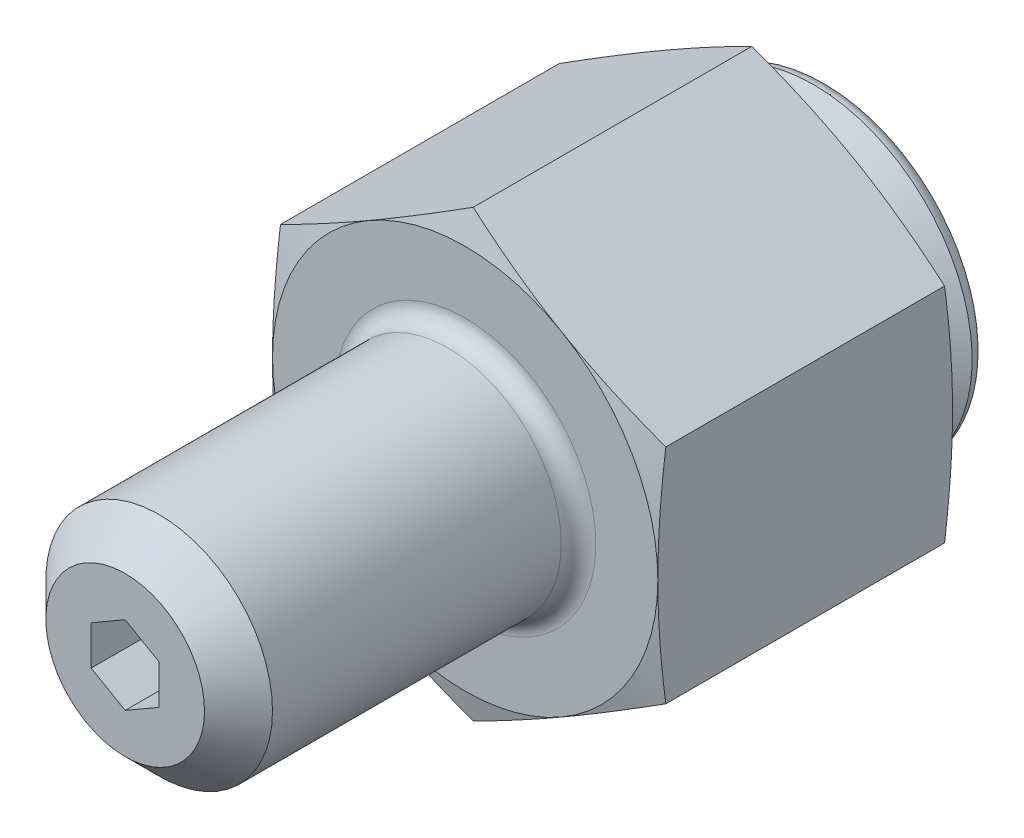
ISO-10303-21;
HEADER;
FILE_DESCRIPTION(('STEP AP214'),'2;1');
FILE_NAME('part.step','',(''),(''),'','','');
FILE_SCHEMA(('AUTOMOTIVE_DESIGN { 1 0 10303 214 1 1 1 1 }'));
ENDSEC;
DATA;
#1=APPLICATION_CONTEXT('core data for automotive mechanical design processes');
#2=APPLICATION_PROTOCOL_DEFINITION('international standard','automotive_design',2000,#1);
#3=PRODUCT_CONTEXT('',#1,'mechanical');
#4=PRODUCT('Part','Part','',(#3));
#5=PRODUCT_RELATED_PRODUCT_CATEGORY('part','',(#4));
#6=PRODUCT_DEFINITION_FORMATION('','',#4);
#7=PRODUCT_DEFINITION_CONTEXT('part definition',#1,'design');
#8=PRODUCT_DEFINITION('design','',#6,#7);
#9=PRODUCT_DEFINITION_SHAPE('','',#8);
#10=(LENGTH_UNIT() NAMED_UNIT(*) SI_UNIT(.MILLI.,.METRE.));
#11=(NAMED_UNIT(*) PLANE_ANGLE_UNIT() SI_UNIT($,.RADIAN.));
#12=(NAMED_UNIT(*) SI_UNIT($,.STERADIAN.) SOLID_ANGLE_UNIT());
#13=UNCERTAINTY_MEASURE_WITH_UNIT(LENGTH_MEASURE(1.E-05),#10,'distance_accuracy_value','');
#14=(GEOMETRIC_REPRESENTATION_CONTEXT(3) GLOBAL_UNCERTAINTY_ASSIGNED_CONTEXT((#13)) GLOBAL_UNIT_ASSIGNED_CONTEXT((#10,
#11,#12)) REPRESENTATION_CONTEXT('',''));
#15=CARTESIAN_POINT('',(0.,0.,0.));
#16=DIRECTION('',(0.,0.,1.));
#17=DIRECTION('',(1.,0.,0.));
#18=AXIS2_PLACEMENT_3D('',#15,#16,#17);
#19=CARTESIAN_POINT('',(0.,0.,6.3503999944));
#20=DIRECTION('',(0.,0.,-1.));
#21=DIRECTION('',(-0.279811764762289,0.96005488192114,0.));
#22=AXIS2_PLACEMENT_3D('',#19,#20,#21);
#23=SPHERICAL_SURFACE('',#22,6.5);
#24=CARTESIAN_POINT('',(0.,0.,4.0159999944));
#25=DIRECTION('',(0.,0.,-1.));
#26=DIRECTION('',(-0.96005488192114,-0.279811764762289,0.));
#27=AXIS2_PLACEMENT_3D('',#24,#25,#26);
#28=CIRCLE('',#27,6.06634788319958);
#29=CARTESIAN_POINT('',(-1.69743550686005,5.82402690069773,4.0159999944));
#30=VERTEX_POINT('',#29);
#31=EDGE_CURVE('E9',#30,#30,#28,.F.);
#32=CARTESIAN_POINT('',(0.,0.,2.88641592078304));
#33=DIRECTION('',(0.,0.,1.));
#34=DIRECTION('',(-0.279811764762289,0.96005488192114,0.));
#35=AXIS2_PLACEMENT_3D('',#32,#33,#34);
#36=CIRCLE('',#35,5.50007403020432);
#37=CARTESIAN_POINT('',(-1.5389854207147,5.28037292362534,2.88641592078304));
#38=VERTEX_POINT('',#37);
#39=EDGE_CURVE('E359',#38,#38,#36,.T.);
#40=CARTESIAN_POINT('',(-1.69743550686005,5.82402690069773,4.0159999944));
#41=CARTESIAN_POINT('',(-1.69611072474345,5.81948147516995,4.00369644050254));
#42=CARTESIAN_POINT('',(-1.69477546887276,5.81490011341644,3.99140729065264));
#43=CARTESIAN_POINT('',(-1.69208405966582,5.80566568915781,3.96685825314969));
#44=CARTESIAN_POINT('',(-1.69072790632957,5.80101262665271,3.95459836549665));
#45=CARTESIAN_POINT('',(-1.68799475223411,5.7916349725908,3.93010830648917));
#46=CARTESIAN_POINT('',(-1.6866177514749,5.786910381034,3.91787813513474));
#47=CARTESIAN_POINT('',(-1.68384295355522,5.77738984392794,3.89344796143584));
#48=CARTESIAN_POINT('',(-1.68244515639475,5.77259389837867,3.88124795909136));
#49=CARTESIAN_POINT('',(-1.67962881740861,5.76293083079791,3.85687857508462));
#50=CARTESIAN_POINT('',(-1.67821027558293,5.75806370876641,3.84470919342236));
#51=CARTESIAN_POINT('',(-1.67535249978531,5.74825846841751,3.82040150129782));
#52=CARTESIAN_POINT('',(-1.67391326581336,5.7433203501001,3.80826319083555));
#53=CARTESIAN_POINT('',(-1.67101415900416,5.73337329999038,3.78401809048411));
#54=CARTESIAN_POINT('',(-1.66955428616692,5.72836436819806,3.77191130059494));
#55=CARTESIAN_POINT('',(-1.66661395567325,5.71827587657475,3.74772968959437));
#56=CARTESIAN_POINT('',(-1.66513349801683,5.71319631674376,3.73565486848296));
#57=CARTESIAN_POINT('',(-1.66215205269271,5.70296675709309,3.71153764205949));
#58=CARTESIAN_POINT('',(-1.66065106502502,5.6978167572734,3.69949523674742));
#59=CARTESIAN_POINT('',(-1.65762861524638,5.68744650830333,3.67544328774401));
#60=CARTESIAN_POINT('',(-1.65610715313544,5.68222625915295,3.66343374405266));
#61=CARTESIAN_POINT('',(-1.65304381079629,5.6717157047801,3.63944796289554));
#62=CARTESIAN_POINT('',(-1.65150193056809,5.66642539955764,3.62747172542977));
#63=CARTESIAN_POINT('',(-1.6483978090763,5.65577492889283,3.60355300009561));
#64=CARTESIAN_POINT('',(-1.64683556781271,5.65041476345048,3.59161051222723));
#65=CARTESIAN_POINT('',(-1.64369078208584,5.63962477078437,3.56775972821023));
#66=CARTESIAN_POINT('',(-1.64210823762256,5.6341949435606,3.55585143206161));
#67=CARTESIAN_POINT('',(-1.63892290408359,5.62326582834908,3.53206947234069));
#68=CARTESIAN_POINT('',(-1.63732011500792,5.61776654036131,3.5201958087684));
#69=CARTESIAN_POINT('',(-1.63409435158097,5.60669870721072,3.49648355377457));
#70=CARTESIAN_POINT('',(-1.6324713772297,5.60113016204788,3.48464496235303));
#71=CARTESIAN_POINT('',(-1.62920530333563,5.58992402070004,3.46100328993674));
#72=CARTESIAN_POINT('',(-1.62756220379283,5.58428642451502,3.44920020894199));
#73=CARTESIAN_POINT('',(-1.62425594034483,5.57294238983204,3.42562999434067));
#74=CARTESIAN_POINT('',(-1.62259277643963,5.56723595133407,3.41386286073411));
#75=CARTESIAN_POINT('',(-1.61924644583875,5.55575444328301,3.39036497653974));
#76=CARTESIAN_POINT('',(-1.61756327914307,5.54997937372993,3.37863422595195));
#77=CARTESIAN_POINT('',(-1.61417700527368,5.53836081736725,3.35520954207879));
#78=CARTESIAN_POINT('',(-1.61247389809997,5.53251733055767,3.34351560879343));
#79=CARTESIAN_POINT('',(-1.60904780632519,5.5207621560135,3.32016499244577));
#80=CARTESIAN_POINT('',(-1.60732482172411,5.51485046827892,3.30850830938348));
#81=CARTESIAN_POINT('',(-1.60385903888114,5.50295911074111,3.28523262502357));
#82=CARTESIAN_POINT('',(-1.60211624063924,5.49697944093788,3.27361362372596));
#83=CARTESIAN_POINT('',(-1.59861089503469,5.48495234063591,3.25041373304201));
#84=CARTESIAN_POINT('',(-1.59684834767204,5.47890491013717,3.23883284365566));
#85=CARTESIAN_POINT('',(-1.59330356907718,5.46674251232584,3.2157096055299));
#86=CARTESIAN_POINT('',(-1.59152133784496,5.46062754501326,3.20416725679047));
#87=CARTESIAN_POINT('',(-1.5879372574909,5.44833029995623,3.18112152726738));
#88=CARTESIAN_POINT('',(-1.58613540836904,5.44214802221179,3.16961814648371));
#89=CARTESIAN_POINT('',(-1.58251215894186,5.42971638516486,3.14665077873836));
#90=CARTESIAN_POINT('',(-1.58069075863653,5.42346702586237,3.13518679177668));
#91=CARTESIAN_POINT('',(-1.57702847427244,5.41090145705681,3.112298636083));
#92=CARTESIAN_POINT('',(-1.57518759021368,5.40458524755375,3.100874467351));
#93=CARTESIAN_POINT('',(-1.57148640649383,5.39188621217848,3.07806637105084));
#94=CARTESIAN_POINT('',(-1.56962610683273,5.38550338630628,3.06668244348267));
#95=CARTESIAN_POINT('',(-1.56588616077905,5.37267135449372,3.04395525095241));
#96=CARTESIAN_POINT('',(-1.56400651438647,5.36622214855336,3.03261198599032));
#97=CARTESIAN_POINT('',(-1.56022794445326,5.35325759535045,3.00996653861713));
#98=CARTESIAN_POINT('',(-1.55832902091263,5.34674224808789,2.99866435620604));
#99=CARTESIAN_POINT('',(-1.55451196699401,5.33364565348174,2.97610149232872));
#100=CARTESIAN_POINT('',(-1.55259383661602,5.32706440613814,2.96484081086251));
#101=CARTESIAN_POINT('',(-1.54873843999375,5.31383625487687,2.94236136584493));
#102=CARTESIAN_POINT('',(-1.54680117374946,5.30718935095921,2.93114260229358));
#103=CARTESIAN_POINT('',(-1.5429075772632,5.29383013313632,2.90874740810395));
#104=CARTESIAN_POINT('',(-1.54095124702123,5.2871178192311,2.89757097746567));
#105=CARTESIAN_POINT('',(-1.5389854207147,5.28037292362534,2.88641592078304));
#106=B_SPLINE_CURVE_WITH_KNOTS('',3,(#40,#41,#42,#43,#44,#45,#46,#47,#48,#49,#50,#51,#52,#53,
#54,#55,#56,#57,#58,#59,#60,#61,#62,#63,#64,#65,#66,#67,#68,#69,#70,#71,#72,#73,#74,#75,#76,#77,
#78,#79,#80,#81,#82,#83,#84,#85,#86,#87,#88,#89,#90,#91,#92,#93,#94,#95,#96,#97,#98,#99,#100,
#101,#102,#103,#104,#105),.UNSPECIFIED.,.F.,.F.,(4,2,2,2,2,2,2,2,2,2,2,2,2,2,2,2,2,2,2,2,2,2,2,
2,2,2,2,2,2,2,2,2,4),(0.,0.0395491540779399,0.0790983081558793,0.118647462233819,
0.15819661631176,0.1977457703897,0.23729492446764,0.27684407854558,0.31639323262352,
0.35594238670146,0.3954915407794,0.43504069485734,0.47458984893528,0.51413900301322,
0.55368815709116,0.5932373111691,0.63278646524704,0.672335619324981,0.71188477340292,
0.751433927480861,0.7909830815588,0.83053223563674,0.87008138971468,0.90963054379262,
0.949179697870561,0.988728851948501,1.02827800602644,1.06782716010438,1.10737631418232,
1.14692546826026,1.1864746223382,1.22602377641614,1.26557293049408),.UNSPECIFIED.);
#107=EDGE_CURVE('BSEAM14',#30,#38,#106,.T.);
#108=ORIENTED_EDGE('',*,*,#31,.F.);
#109=ORIENTED_EDGE('',*,*,#39,.T.);
#110=ORIENTED_EDGE('',*,*,#107,.T.);
#111=ORIENTED_EDGE('',*,*,#107,.F.);
#112=EDGE_LOOP('',(#108,#110,#109,#111));
#113=FACE_BOUND('',#112,.T.);
#114=ADVANCED_FACE('F14',(#113),#23,.T.);
#115=CARTESIAN_POINT('',(0.,0.,0.));
#116=DIRECTION('',(0.,0.,-1.));
#117=DIRECTION('',(0.279811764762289,-0.96005488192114,0.));
#118=AXIS2_PLACEMENT_3D('',#115,#116,#117);
#119=CYLINDRICAL_SURFACE('',#118,5.461);
#120=CARTESIAN_POINT('',(0.,0.,2.75105408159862));
#121=DIRECTION('',(0.,0.,1.));
#122=DIRECTION('',(-0.279811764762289,0.96005488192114,0.));
#123=AXIS2_PLACEMENT_3D('',#120,#121,#122);
#124=CIRCLE('',#123,5.461);
#125=CARTESIAN_POINT('',(-1.52805204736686,5.24285971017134,2.75105408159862));
#126=VERTEX_POINT('',#125);
#127=EDGE_CURVE('E357',#126,#126,#124,.F.);
#128=ORIENTED_EDGE('',*,*,#127,.T.);
#129=EDGE_LOOP('',(#128));
#130=FACE_BOUND('',#129,.T.);
#131=CARTESIAN_POINT('',(0.,0.,1.670189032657));
#132=DIRECTION('',(0.,0.,-1.));
#133=DIRECTION('',(0.279811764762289,-0.96005488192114,0.));
#134=AXIS2_PLACEMENT_3D('',#131,#132,#133);
#135=CIRCLE('',#134,5.461);
#136=CARTESIAN_POINT('',(1.52805204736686,-5.24285971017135,1.670189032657));
#137=VERTEX_POINT('',#136);
#138=EDGE_CURVE('E354',#137,#137,#135,.F.);
#139=ORIENTED_EDGE('',*,*,#138,.T.);
#140=EDGE_LOOP('',(#139));
#141=FACE_BOUND('',#140,.T.);
#142=ADVANCED_FACE('F378',(#130,#141),#119,.T.);
#143=CARTESIAN_POINT('',(0.,0.,1.52354206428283));
#144=DIRECTION('',(0.,0.,-1.));
#145=DIRECTION('',(0.279811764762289,-0.96005488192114,0.));
#146=AXIS2_PLACEMENT_3D('',#143,#144,#145);
#147=CONICAL_SURFACE('',#146,5.461,1.0471975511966);
#148=CARTESIAN_POINT('',(0.,0.,1.45021858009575));
#149=DIRECTION('',(0.,0.,-1.));
#150=DIRECTION('',(0.279811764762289,-0.96005488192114,0.));
#151=AXIS2_PLACEMENT_3D('',#148,#149,#150);
#152=CIRCLE('',#151,5.588);
#153=CARTESIAN_POINT('',(1.56358814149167,-5.36478668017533,1.45021858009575));
#154=VERTEX_POINT('',#153);
#155=EDGE_CURVE('E18',#154,#154,#152,.T.);
#156=ORIENTED_EDGE('',*,*,#155,.T.);
#157=EDGE_LOOP('',(#156));
#158=FACE_BOUND('',#157,.T.);
#159=CARTESIAN_POINT('',(0.,0.,0.635));
#160=DIRECTION('',(0.,0.,-1.));
#161=DIRECTION('',(0.279811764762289,-0.96005488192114,0.));
#162=AXIS2_PLACEMENT_3D('',#159,#160,#161);
#163=CIRCLE('',#162,7.);
#164=CARTESIAN_POINT('',(1.95868235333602,-6.72038417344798,0.635));
#165=VERTEX_POINT('',#164);
#166=EDGE_CURVE('E348',#165,#165,#163,.T.);
#167=ORIENTED_EDGE('',*,*,#166,.F.);
#168=EDGE_LOOP('',(#167));
#169=FACE_BOUND('',#168,.T.);
#170=ADVANCED_FACE('F384',(#158,#169),#147,.T.);
#171=CARTESIAN_POINT('',(-1.95868235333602,6.72038417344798,0.));
#172=DIRECTION('',(0.,0.,1.));
#173=DIRECTION('',(-0.279811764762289,0.96005488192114,0.));
#174=AXIS2_PLACEMENT_3D('',#171,#172,#173);
#175=PLANE('',#174);
#176=CARTESIAN_POINT('',(0.,0.,0.));
#177=DIRECTION('',(0.,0.,1.));
#178=DIRECTION('',(-0.279811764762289,0.96005488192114,0.));
#179=AXIS2_PLACEMENT_3D('',#176,#177,#178);
#180=CIRCLE('',#179,6.365);
#181=CARTESIAN_POINT('',(-1.78100188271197,6.11074932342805,0.));
#182=VERTEX_POINT('',#181);
#183=EDGE_CURVE('E351',#182,#182,#180,.F.);
#184=ORIENTED_EDGE('',*,*,#183,.T.);
#185=EDGE_LOOP('',(#184));
#186=FACE_BOUND('',#185,.T.);
#187=ADVANCED_FACE('F444',(#186),#175,.F.);
#188=CARTESIAN_POINT('',(0.,0.,0.635));
#189=DIRECTION('',(0.,0.,1.));
#190=DIRECTION('',(-0.279811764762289,0.96005488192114,0.));
#191=AXIS2_PLACEMENT_3D('',#188,#189,#190);
#192=TOROIDAL_SURFACE('',#191,6.365,0.635);
#193=ORIENTED_EDGE('',*,*,#166,.T.);
#194=EDGE_LOOP('',(#193));
#195=FACE_BOUND('',#194,.T.);
#196=ORIENTED_EDGE('',*,*,#183,.F.);
#197=EDGE_LOOP('',(#196));
#198=FACE_BOUND('',#197,.T.);
#199=ADVANCED_FACE('F447',(#195,#198),#192,.T.);
#200=CARTESIAN_POINT('',(0.,0.,2.75105408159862));
#201=DIRECTION('',(0.,0.,1.));
#202=DIRECTION('',(-0.279811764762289,0.96005488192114,0.));
#203=AXIS2_PLACEMENT_3D('',#200,#201,#202);
#204=TOROIDAL_SURFACE('',#203,5.715,0.254);
#205=ORIENTED_EDGE('',*,*,#39,.F.);
#206=EDGE_LOOP('',(#205));
#207=FACE_BOUND('',#206,.T.);
#208=ORIENTED_EDGE('',*,*,#127,.F.);
#209=EDGE_LOOP('',(#208));
#210=FACE_BOUND('',#209,.T.);
#211=ADVANCED_FACE('F396',(#207,#210),#204,.F.);
#212=CARTESIAN_POINT('',(0.,0.,1.670189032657));
#213=DIRECTION('',(0.,0.,-1.));
#214=DIRECTION('',(0.279811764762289,-0.96005488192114,0.));
#215=AXIS2_PLACEMENT_3D('',#212,#213,#214);
#216=TOROIDAL_SURFACE('',#215,5.715,0.254);
#217=ORIENTED_EDGE('',*,*,#138,.F.);
#218=EDGE_LOOP('',(#217));
#219=FACE_BOUND('',#218,.T.);
#220=ORIENTED_EDGE('',*,*,#155,.F.);
#221=EDGE_LOOP('',(#220));
#222=FACE_BOUND('',#221,.T.);
#223=ADVANCED_FACE('F16',(#219,#222),#216,.F.);
#224=CARTESIAN_POINT('',(-3.,0.,26.9999999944));
#225=DIRECTION('',(0.,0.,-1.));
#226=DIRECTION('',(-1.,0.,0.));
#227=AXIS2_PLACEMENT_3D('',#224,#225,#226);
#228=PLANE('',#227);
#229=DIRECTION('',(0.866025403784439,-0.5,0.));
#230=VECTOR('',#229,1.);
#231=CARTESIAN_POINT('',(-1.5,-0.866025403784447,26.9999999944));
#232=LINE('',#231,#230);
#233=CARTESIAN_POINT('',(-1.5,-0.866025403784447,26.9999999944));
#234=VERTEX_POINT('',#233);
#235=CARTESIAN_POINT('',(0.,-1.73205080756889,26.9999999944));
#236=VERTEX_POINT('',#235);
#237=EDGE_CURVE('E144',#234,#236,#232,.T.);
#238=ORIENTED_EDGE('',*,*,#237,.T.);
#239=DIRECTION('',(0.866025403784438,0.5,0.));
#240=VECTOR('',#239,1.);
#241=CARTESIAN_POINT('',(0.,-1.73205080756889,26.9999999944));
#242=LINE('',#241,#240);
#243=CARTESIAN_POINT('',(1.5,-0.866025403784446,26.9999999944));
#244=VERTEX_POINT('',#243);
#245=EDGE_CURVE('E153',#236,#244,#242,.T.);
#246=ORIENTED_EDGE('',*,*,#245,.T.);
#247=DIRECTION('',(0.,1.,0.));
#248=VECTOR('',#247,1.);
#249=CARTESIAN_POINT('',(1.5,-0.866025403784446,26.9999999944));
#250=LINE('',#249,#248);
#251=CARTESIAN_POINT('',(1.5,0.866025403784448,26.9999999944));
#252=VERTEX_POINT('',#251);
#253=EDGE_CURVE('E158',#244,#252,#250,.T.);
#254=ORIENTED_EDGE('',*,*,#253,.T.);
#255=DIRECTION('',(-0.866025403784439,0.5,0.));
#256=VECTOR('',#255,1.);
#257=CARTESIAN_POINT('',(1.5,0.866025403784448,26.9999999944));
#258=LINE('',#257,#256);
#259=CARTESIAN_POINT('',(0.,1.73205080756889,26.9999999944));
#260=VERTEX_POINT('',#259);
#261=EDGE_CURVE('E172',#252,#260,#258,.T.);
#262=ORIENTED_EDGE('',*,*,#261,.T.);
#263=DIRECTION('',(-0.866025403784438,-0.5,0.));
#264=VECTOR('',#263,1.);
#265=CARTESIAN_POINT('',(0.,1.73205080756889,26.9999999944));
#266=LINE('',#265,#264);
#267=CARTESIAN_POINT('',(-1.5,0.866025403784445,26.9999999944));
#268=VERTEX_POINT('',#267);
#269=EDGE_CURVE('E175',#260,#268,#266,.T.);
#270=ORIENTED_EDGE('',*,*,#269,.T.);
#271=DIRECTION('',(0.,-1.,0.));
#272=VECTOR('',#271,1.);
#273=CARTESIAN_POINT('',(-1.5,0.866025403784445,26.9999999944));
#274=LINE('',#273,#272);
#275=EDGE_CURVE('E150',#268,#234,#274,.T.);
#276=ORIENTED_EDGE('',*,*,#275,.T.);
#277=EDGE_LOOP('',(#238,#246,#254,#262,#270,#276));
#278=FACE_BOUND('',#277,.T.);
#279=ADVANCED_FACE('F160',(#278),#228,.F.);
#280=CARTESIAN_POINT('',(0.,-1.73205080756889,26.9999999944));
#281=DIRECTION('',(0.5,-0.866025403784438,0.));
#282=DIRECTION('',(-0.866025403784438,-0.5,0.));
#283=AXIS2_PLACEMENT_3D('',#280,#281,#282);
#284=PLANE('',#283);
#285=DIRECTION('',(0.866025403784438,0.5,0.));
#286=VECTOR('',#285,1.);
#287=CARTESIAN_POINT('',(0.,-1.73205080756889,30.9999999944));
#288=LINE('',#287,#286);
#289=CARTESIAN_POINT('',(0.,-1.73205080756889,30.9999999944));
#290=VERTEX_POINT('',#289);
#291=CARTESIAN_POINT('',(1.5,-0.866025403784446,30.9999999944));
#292=VERTEX_POINT('',#291);
#293=EDGE_CURVE('E179',#290,#292,#288,.T.);
#294=ORIENTED_EDGE('',*,*,#293,.T.);
#295=DIRECTION('',(0.,0.,1.));
#296=VECTOR('',#295,1.);
#297=CARTESIAN_POINT('',(1.5,-0.866025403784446,26.9999999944));
#298=LINE('',#297,#296);
#299=EDGE_CURVE('E149',#244,#292,#298,.T.);
#300=ORIENTED_EDGE('',*,*,#299,.F.);
#301=ORIENTED_EDGE('',*,*,#245,.F.);
#302=DIRECTION('',(0.,0.,1.));
#303=VECTOR('',#302,1.);
#304=CARTESIAN_POINT('',(0.,-1.73205080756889,26.9999999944));
#305=LINE('',#304,#303);
#306=EDGE_CURVE('E140',#236,#290,#305,.T.);
#307=ORIENTED_EDGE('',*,*,#306,.T.);
#308=EDGE_LOOP('',(#294,#300,#301,#307));
#309=FACE_BOUND('',#308,.T.);
#310=ADVANCED_FACE('F154',(#309),#284,.F.);
#311=CARTESIAN_POINT('',(1.5,-0.866025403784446,26.9999999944));
#312=DIRECTION('',(1.,0.,0.));
#313=DIRECTION('',(0.,-1.,0.));
#314=AXIS2_PLACEMENT_3D('',#311,#312,#313);
#315=PLANE('',#314);
#316=DIRECTION('',(0.,1.,0.));
#317=VECTOR('',#316,1.);
#318=CARTESIAN_POINT('',(1.5,-0.866025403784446,30.9999999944));
#319=LINE('',#318,#317);
#320=CARTESIAN_POINT('',(1.5,0.866025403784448,30.9999999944));
#321=VERTEX_POINT('',#320);
#322=EDGE_CURVE('E181',#292,#321,#319,.T.);
#323=ORIENTED_EDGE('',*,*,#322,.T.);
#324=DIRECTION('',(0.,0.,1.));
#325=VECTOR('',#324,1.);
#326=CARTESIAN_POINT('',(1.5,0.866025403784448,26.9999999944));
#327=LINE('',#326,#325);
#328=EDGE_CURVE('E196',#252,#321,#327,.T.);
#329=ORIENTED_EDGE('',*,*,#328,.F.);
#330=ORIENTED_EDGE('',*,*,#253,.F.);
#331=ORIENTED_EDGE('',*,*,#299,.T.);
#332=EDGE_LOOP('',(#323,#329,#330,#331));
#333=FACE_BOUND('',#332,.T.);
#334=ADVANCED_FACE('F394',(#333),#315,.F.);
#335=CARTESIAN_POINT('',(1.5,0.866025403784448,26.9999999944));
#336=DIRECTION('',(0.5,0.866025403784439,0.));
#337=DIRECTION('',(0.866025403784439,-0.5,0.));
#338=AXIS2_PLACEMENT_3D('',#335,#336,#337);
#339=PLANE('',#338);
#340=DIRECTION('',(-0.866025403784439,0.5,0.));
#341=VECTOR('',#340,1.);
#342=CARTESIAN_POINT('',(1.5,0.866025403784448,30.9999999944));
#343=LINE('',#342,#341);
#344=CARTESIAN_POINT('',(0.,1.73205080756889,30.9999999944));
#345=VERTEX_POINT('',#344);
#346=EDGE_CURVE('E184',#321,#345,#343,.T.);
#347=ORIENTED_EDGE('',*,*,#346,.T.);
#348=DIRECTION('',(0.,0.,1.));
#349=VECTOR('',#348,1.);
#350=CARTESIAN_POINT('',(0.,1.73205080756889,26.9999999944));
#351=LINE('',#350,#349);
#352=EDGE_CURVE('E194',#260,#345,#351,.T.);
#353=ORIENTED_EDGE('',*,*,#352,.F.);
#354=ORIENTED_EDGE('',*,*,#261,.F.);
#355=ORIENTED_EDGE('',*,*,#328,.T.);
#356=EDGE_LOOP('',(#347,#353,#354,#355));
#357=FACE_BOUND('',#356,.T.);
#358=ADVANCED_FACE('F406',(#357),#339,.F.);
#359=CARTESIAN_POINT('',(0.,1.73205080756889,26.9999999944));
#360=DIRECTION('',(-0.5,0.866025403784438,0.));
#361=DIRECTION('',(0.866025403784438,0.5,0.));
#362=AXIS2_PLACEMENT_3D('',#359,#360,#361);
#363=PLANE('',#362);
#364=DIRECTION('',(-0.866025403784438,-0.5,0.));
#365=VECTOR('',#364,1.);
#366=CARTESIAN_POINT('',(0.,1.73205080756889,30.9999999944));
#367=LINE('',#366,#365);
#368=CARTESIAN_POINT('',(-1.5,0.866025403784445,30.9999999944));
#369=VERTEX_POINT('',#368);
#370=EDGE_CURVE('E166',#345,#369,#367,.T.);
#371=ORIENTED_EDGE('',*,*,#370,.T.);
#372=DIRECTION('',(0.,0.,1.));
#373=VECTOR('',#372,1.);
#374=CARTESIAN_POINT('',(-1.5,0.866025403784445,26.9999999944));
#375=LINE('',#374,#373);
#376=EDGE_CURVE('E192',#268,#369,#375,.T.);
#377=ORIENTED_EDGE('',*,*,#376,.F.);
#378=ORIENTED_EDGE('',*,*,#269,.F.);
#379=ORIENTED_EDGE('',*,*,#352,.T.);
#380=EDGE_LOOP('',(#371,#377,#378,#379));
#381=FACE_BOUND('',#380,.T.);
#382=ADVANCED_FACE('F402',(#381),#363,.F.);
#383=CARTESIAN_POINT('',(-1.5,0.866025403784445,26.9999999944));
#384=DIRECTION('',(-1.,0.,0.));
#385=DIRECTION('',(0.,0.,1.));
#386=AXIS2_PLACEMENT_3D('',#383,#384,#385);
#387=PLANE('',#386);
#388=DIRECTION('',(0.,-1.,0.));
#389=VECTOR('',#388,1.);
#390=CARTESIAN_POINT('',(-1.5,0.866025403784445,30.9999999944));
#391=LINE('',#390,#389);
#392=CARTESIAN_POINT('',(-1.5,-0.866025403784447,30.9999999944));
#393=VERTEX_POINT('',#392);
#394=EDGE_CURVE('E163',#369,#393,#391,.T.);
#395=ORIENTED_EDGE('',*,*,#394,.T.);
#396=DIRECTION('',(0.,0.,1.));
#397=VECTOR('',#396,1.);
#398=CARTESIAN_POINT('',(-1.5,-0.866025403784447,26.9999999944));
#399=LINE('',#398,#397);
#400=EDGE_CURVE('E189',#234,#393,#399,.T.);
#401=ORIENTED_EDGE('',*,*,#400,.F.);
#402=ORIENTED_EDGE('',*,*,#275,.F.);
#403=ORIENTED_EDGE('',*,*,#376,.T.);
#404=EDGE_LOOP('',(#395,#401,#402,#403));
#405=FACE_BOUND('',#404,.T.);
#406=ADVANCED_FACE('F399',(#405),#387,.F.);
#407=CARTESIAN_POINT('',(-1.5,-0.866025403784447,26.9999999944));
#408=DIRECTION('',(-0.5,-0.866025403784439,0.));
#409=DIRECTION('',(-0.866025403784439,0.5,0.));
#410=AXIS2_PLACEMENT_3D('',#407,#408,#409);
#411=PLANE('',#410);
#412=DIRECTION('',(0.866025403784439,-0.5,0.));
#413=VECTOR('',#412,1.);
#414=CARTESIAN_POINT('',(-1.5,-0.866025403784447,30.9999999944));
#415=LINE('',#414,#413);
#416=EDGE_CURVE('E31',#393,#290,#415,.T.);
#417=ORIENTED_EDGE('',*,*,#416,.T.);
#418=ORIENTED_EDGE('',*,*,#306,.F.);
#419=ORIENTED_EDGE('',*,*,#237,.F.);
#420=ORIENTED_EDGE('',*,*,#400,.T.);
#421=EDGE_LOOP('',(#417,#418,#419,#420));
#422=FACE_BOUND('',#421,.T.);
#423=ADVANCED_FACE('F142',(#422),#411,.F.);
#424=CARTESIAN_POINT('',(0.,0.,30.9999999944));
#425=DIRECTION('',(0.,0.,1.));
#426=DIRECTION('',(1.,0.,0.));
#427=AXIS2_PLACEMENT_3D('',#424,#425,#426);
#428=PLANE('',#427);
#429=ORIENTED_EDGE('',*,*,#416,.F.);
#430=ORIENTED_EDGE('',*,*,#394,.F.);
#431=ORIENTED_EDGE('',*,*,#370,.F.);
#432=ORIENTED_EDGE('',*,*,#346,.F.);
#433=ORIENTED_EDGE('',*,*,#322,.F.);
#434=ORIENTED_EDGE('',*,*,#293,.F.);
#435=EDGE_LOOP('',(#429,#430,#431,#432,#433,#434));
#436=FACE_BOUND('',#435,.T.);
#437=CARTESIAN_POINT('',(0.,0.,30.9999999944));
#438=DIRECTION('',(0.,0.,1.));
#439=DIRECTION('',(1.,0.,0.));
#440=AXIS2_PLACEMENT_3D('',#437,#438,#439);
#441=CIRCLE('',#440,3.5);
#442=CARTESIAN_POINT('',(3.5,0.,30.9999999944));
#443=VERTEX_POINT('',#442);
#444=EDGE_CURVE('E343',#443,#443,#441,.T.);
#445=ORIENTED_EDGE('',*,*,#444,.T.);
#446=EDGE_LOOP('',(#445));
#447=FACE_BOUND('',#446,.T.);
#448=ADVANCED_FACE('F416',(#436,#447),#428,.T.);
#449=CARTESIAN_POINT('',(0.,0.,30.9999999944));
#450=DIRECTION('',(0.,0.,-1.));
#451=DIRECTION('',(-1.,0.,0.));
#452=AXIS2_PLACEMENT_3D('',#449,#450,#451);
#453=CONICAL_SURFACE('',#452,3.5,0.785398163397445);
#454=CARTESIAN_POINT('',(0.,0.,29.4999999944));
#455=DIRECTION('',(0.,0.,1.));
#456=DIRECTION('',(1.,0.,0.));
#457=AXIS2_PLACEMENT_3D('',#454,#455,#456);
#458=CIRCLE('',#457,5.);
#459=CARTESIAN_POINT('',(5.,0.,29.4999999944));
#460=VERTEX_POINT('',#459);
#461=EDGE_CURVE('E23',#460,#460,#458,.F.);
#462=ORIENTED_EDGE('',*,*,#461,.F.);
#463=EDGE_LOOP('',(#462));
#464=FACE_BOUND('',#463,.T.);
#465=ORIENTED_EDGE('',*,*,#444,.F.);
#466=EDGE_LOOP('',(#465));
#467=FACE_BOUND('',#466,.T.);
#468=ADVANCED_FACE('F418',(#464,#467),#453,.T.);
#469=CARTESIAN_POINT('',(0.,0.,30.9999999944));
#470=DIRECTION('',(0.,0.,-1.));
#471=DIRECTION('',(-1.,0.,0.));
#472=AXIS2_PLACEMENT_3D('',#469,#470,#471);
#473=CYLINDRICAL_SURFACE('',#472,5.);
#474=ORIENTED_EDGE('',*,*,#461,.T.);
#475=EDGE_LOOP('',(#474));
#476=FACE_BOUND('',#475,.T.);
#477=CARTESIAN_POINT('',(0.,0.,16.7619999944));
#478=DIRECTION('',(0.,0.,1.));
#479=DIRECTION('',(1.,0.,0.));
#480=AXIS2_PLACEMENT_3D('',#477,#478,#479);
#481=CIRCLE('',#480,5.);
#482=CARTESIAN_POINT('',(5.,0.,16.7619999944));
#483=VERTEX_POINT('',#482);
#484=EDGE_CURVE('E337',#483,#483,#481,.T.);
#485=ORIENTED_EDGE('',*,*,#484,.T.);
#486=EDGE_LOOP('',(#485));
#487=FACE_BOUND('',#486,.T.);
#488=ADVANCED_FACE('F420',(#476,#487),#473,.T.);
#489=CARTESIAN_POINT('',(0.,0.,16.7619999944));
#490=DIRECTION('',(0.,0.,1.));
#491=DIRECTION('',(1.,0.,0.));
#492=AXIS2_PLACEMENT_3D('',#489,#490,#491);
#493=TOROIDAL_SURFACE('',#492,5.762,0.762);
#494=CARTESIAN_POINT('',(0.,0.,15.9999999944));
#495=DIRECTION('',(0.,0.,1.));
#496=DIRECTION('',(1.,0.,0.));
#497=AXIS2_PLACEMENT_3D('',#494,#495,#496);
#498=CIRCLE('',#497,5.762);
#499=CARTESIAN_POINT('',(5.762,0.,15.9999999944));
#500=VERTEX_POINT('',#499);
#501=EDGE_CURVE('E340',#500,#500,#498,.F.);
#502=ORIENTED_EDGE('',*,*,#501,.F.);
#503=EDGE_LOOP('',(#502));
#504=FACE_BOUND('',#503,.T.);
#505=ORIENTED_EDGE('',*,*,#484,.F.);
#506=EDGE_LOOP('',(#505));
#507=FACE_BOUND('',#506,.T.);
#508=ADVANCED_FACE('F422',(#504,#507),#493,.F.);
#509=CARTESIAN_POINT('',(-8.5,-14.7224318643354,15.9999999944));
#510=DIRECTION('',(0.,0.,1.));
#511=DIRECTION('',(1.,0.,0.));
#512=AXIS2_PLACEMENT_3D('',#509,#510,#511);
#513=PLANE('',#512);
#514=CARTESIAN_POINT('',(0.,0.,15.9999999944));
#515=DIRECTION('',(0.,0.,1.));
#516=DIRECTION('',(1.,0.,0.));
#517=AXIS2_PLACEMENT_3D('',#514,#515,#516);
#518=CIRCLE('',#517,8.5);
#519=CARTESIAN_POINT('',(4.25,-7.36121593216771,15.9999999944));
#520=VERTEX_POINT('',#519);
#521=CARTESIAN_POINT('',(8.5,0.,15.9999999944));
#522=VERTEX_POINT('',#521);
#523=EDGE_CURVE('E306',#520,#522,#518,.T.);
#524=ORIENTED_EDGE('',*,*,#523,.T.);
#525=CARTESIAN_POINT('',(4.25,7.36121593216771,15.9999999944));
#526=VERTEX_POINT('',#525);
#527=EDGE_CURVE('E325',#522,#526,#518,.T.);
#528=ORIENTED_EDGE('',*,*,#527,.T.);
#529=CARTESIAN_POINT('',(-4.25,7.36121593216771,15.9999999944));
#530=VERTEX_POINT('',#529);
#531=EDGE_CURVE('E824',#526,#530,#518,.T.);
#532=ORIENTED_EDGE('',*,*,#531,.T.);
#533=CARTESIAN_POINT('',(0.,0.,15.9999999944));
#534=DIRECTION('',(0.,0.,-1.));
#535=DIRECTION('',(-1.,0.,0.));
#536=AXIS2_PLACEMENT_3D('',#533,#534,#535);
#537=CIRCLE('',#536,8.5);
#538=CARTESIAN_POINT('',(-8.5,0.,15.9999999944));
#539=VERTEX_POINT('',#538);
#540=EDGE_CURVE('E788',#539,#530,#537,.T.);
#541=ORIENTED_EDGE('',*,*,#540,.F.);
#542=CARTESIAN_POINT('',(-4.25,-7.36121593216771,15.9999999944));
#543=VERTEX_POINT('',#542);
#544=EDGE_CURVE('E826',#539,#543,#518,.T.);
#545=ORIENTED_EDGE('',*,*,#544,.T.);
#546=EDGE_CURVE('E324',#543,#520,#518,.T.);
#547=ORIENTED_EDGE('',*,*,#546,.T.);
#548=EDGE_LOOP('',(#524,#528,#532,#541,#545,#547));
#549=FACE_BOUND('',#548,.T.);
#550=ORIENTED_EDGE('',*,*,#501,.T.);
#551=EDGE_LOOP('',(#550));
#552=FACE_BOUND('',#551,.T.);
#553=ADVANCED_FACE('F428',(#549,#552),#513,.T.);
#554=CARTESIAN_POINT('',(0.,0.,14.5858363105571));
#555=DIRECTION('',(0.,0.,-1.));
#556=DIRECTION('',(-1.,0.,0.));
#557=AXIS2_PLACEMENT_3D('',#554,#555,#556);
#558=CONICAL_SURFACE('',#557,13.7777307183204,1.30899693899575);
#559=ORIENTED_EDGE('',*,*,#540,.T.);
#560=CARTESIAN_POINT('',(-8.5002,4.90736181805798,15.6476280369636));
#561=CARTESIAN_POINT('',(-8.14719977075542,5.11116659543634,15.7022599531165));
#562=CARTESIAN_POINT('',(-7.7935595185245,5.31534089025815,15.7518566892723));
#563=CARTESIAN_POINT('',(-7.08503012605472,5.72441052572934,15.8389934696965));
#564=CARTESIAN_POINT('',(-6.73014053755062,5.92930612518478,15.8765286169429));
#565=CARTESIAN_POINT('',(-6.02126413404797,6.33857610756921,15.9373509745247));
#566=CARTESIAN_POINT('',(-5.66728211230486,6.54294772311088,15.9607107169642));
#567=CARTESIAN_POINT('',(-4.95886665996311,6.95195157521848,15.9920337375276));
#568=CARTESIAN_POINT('',(-4.60443332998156,7.15658375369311,15.9999999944));
#569=CARTESIAN_POINT('',(-3.89556667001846,7.56584811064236,15.9999999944));
#570=CARTESIAN_POINT('',(-3.54113334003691,7.77048028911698,15.9920337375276));
#571=CARTESIAN_POINT('',(-2.83271788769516,8.17948414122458,15.9607107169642));
#572=CARTESIAN_POINT('',(-2.47873586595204,8.38385575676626,15.9373509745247));
#573=CARTESIAN_POINT('',(-1.76985946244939,8.79312573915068,15.8765286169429));
#574=CARTESIAN_POINT('',(-1.41496987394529,8.99802133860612,15.8389934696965));
#575=CARTESIAN_POINT('',(-0.706440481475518,9.40709097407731,15.7518566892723));
#576=CARTESIAN_POINT('',(-0.352800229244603,9.61126526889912,15.7022599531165));
#577=CARTESIAN_POINT('',(0.00019999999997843,9.81507004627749,15.6476280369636));
#578=B_SPLINE_CURVE_WITH_KNOTS('',3,(#560,#561,#562,#563,#564,#565,#566,#567,#568,#569,#570,
#571,#572,#573,#574,#575,#576,#577),.UNSPECIFIED.,.F.,.F.,(4,2,2,2,2,2,2,2,4),(0.,
1.23382789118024,2.46815608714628,3.69611406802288,4.92383440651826,6.15155474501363,
7.37951272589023,8.61384092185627,9.84766881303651),.UNSPECIFIED.);
#579=CARTESIAN_POINT('',(-8.5,4.90747728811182,15.6476589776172));
#580=VERTEX_POINT('',#579);
#581=EDGE_CURVE('E776',#580,#530,#578,.T.);
#582=ORIENTED_EDGE('',*,*,#581,.F.);
#583=CARTESIAN_POINT('',(-8.5,-13.0512816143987,14.1042136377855));
#584=CARTESIAN_POINT('',(-8.5,-12.6648584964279,14.1909538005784));
#585=CARTESIAN_POINT('',(-8.49999999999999,-12.2781955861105,14.2766446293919));
#586=CARTESIAN_POINT('',(-8.49999999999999,-11.5042722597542,14.4453610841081));
#587=CARTESIAN_POINT('',(-8.49999999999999,-11.117011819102,14.5283865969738));
#588=CARTESIAN_POINT('',(-8.49999999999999,-10.3414386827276,14.6912760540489));
#589=CARTESIAN_POINT('',(-8.5,-9.95312533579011,14.7711369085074));
#590=CARTESIAN_POINT('',(-8.5,-9.17569540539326,14.9268461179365));
#591=CARTESIAN_POINT('',(-8.5,-8.7865788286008,15.0026945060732));
#592=CARTESIAN_POINT('',(-8.5,-8.01051094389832,15.1488360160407));
#593=CARTESIAN_POINT('',(-8.5,-7.62356710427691,15.2191686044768));
#594=CARTESIAN_POINT('',(-8.5,-6.8486278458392,15.3537690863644));
#595=CARTESIAN_POINT('',(-8.5,-6.46063245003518,15.418037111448));
#596=CARTESIAN_POINT('',(-8.5,-5.68350619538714,15.5390761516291));
#597=CARTESIAN_POINT('',(-8.5,-5.29437546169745,15.595847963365));
#598=CARTESIAN_POINT('',(-8.5,-4.51487354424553,15.7002342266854));
#599=CARTESIAN_POINT('',(-8.5,-4.12450235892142,15.7478486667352));
#600=CARTESIAN_POINT('',(-8.5,-3.33808456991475,15.8325873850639));
#601=CARTESIAN_POINT('',(-8.5,-2.94202415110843,15.8695853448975));
#602=CARTESIAN_POINT('',(-8.5,-2.14889276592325,15.9305478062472));
#603=CARTESIAN_POINT('',(-8.5,-1.75182182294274,15.9545126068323));
#604=CARTESIAN_POINT('',(-8.5,-0.957247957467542,15.9880119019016));
#605=CARTESIAN_POINT('',(-8.5,-0.559745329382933,15.9975532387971));
#606=CARTESIAN_POINT('',(-8.5,0.235337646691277,16.0016174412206));
#607=CARTESIAN_POINT('',(-8.5,0.632917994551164,15.996140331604));
#608=CARTESIAN_POINT('',(-8.5,1.42906314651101,15.9704744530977));
#609=CARTESIAN_POINT('',(-8.50000000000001,1.82762616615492,15.9502314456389));
#610=CARTESIAN_POINT('',(-8.50000000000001,2.62382411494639,15.8961949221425));
#611=CARTESIAN_POINT('',(-8.50000000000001,3.0214590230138,15.862401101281));
#612=CARTESIAN_POINT('',(-8.50000000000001,3.8157965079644,15.7829870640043));
#613=CARTESIAN_POINT('',(-8.50000000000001,4.21249828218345,15.7373589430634));
#614=CARTESIAN_POINT('',(-8.50000000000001,5.0046222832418,15.6361961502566));
#615=CARTESIAN_POINT('',(-8.5,5.40004450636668,15.5806614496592));
#616=CARTESIAN_POINT('',(-8.5,6.17208279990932,15.4641342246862));
#617=CARTESIAN_POINT('',(-8.50000000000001,6.54875266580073,15.4034945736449));
#618=CARTESIAN_POINT('',(-8.50000000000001,7.30107458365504,15.2761707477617));
#619=CARTESIAN_POINT('',(-8.50000000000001,7.67672660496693,15.2094863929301));
#620=CARTESIAN_POINT('',(-8.50000000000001,8.42716271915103,15.0712017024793));
#621=CARTESIAN_POINT('',(-8.50000000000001,8.80194671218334,14.9996008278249));
#622=CARTESIAN_POINT('',(-8.50000000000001,9.55072369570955,14.8524099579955));
#623=CARTESIAN_POINT('',(-8.50000000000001,9.9247166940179,14.7768200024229));
#624=CARTESIAN_POINT('',(-8.50000000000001,10.6721291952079,14.6223666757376));
#625=CARTESIAN_POINT('',(-8.50000000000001,11.0455485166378,14.5435024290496));
#626=CARTESIAN_POINT('',(-8.50000000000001,11.7918134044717,14.3831005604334));
#627=CARTESIAN_POINT('',(-8.50000000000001,12.1646589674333,14.3015629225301));
#628=CARTESIAN_POINT('',(-8.50000000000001,13.2824122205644,14.0536763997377));
#629=CARTESIAN_POINT('',(-8.50000000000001,14.0265910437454,13.8840424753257));
#630=CARTESIAN_POINT('',(-8.50000000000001,15.5060345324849,13.5404485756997));
#631=CARTESIAN_POINT('',(-8.50000000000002,16.2413134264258,13.3665494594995));
#632=CARTESIAN_POINT('',(-8.50000000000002,17.7108552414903,13.0144541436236));
#633=CARTESIAN_POINT('',(-8.50000000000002,18.4451181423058,12.8362578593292));
#634=CARTESIAN_POINT('',(-8.50000000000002,19.9119106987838,12.4769434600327));
#635=CARTESIAN_POINT('',(-8.50000000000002,20.6444413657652,12.2958294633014));
#636=CARTESIAN_POINT('',(-8.50000000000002,22.1088735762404,11.9311804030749));
#637=CARTESIAN_POINT('',(-8.50000000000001,22.8407751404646,11.7476454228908));
#638=CARTESIAN_POINT('',(-8.5,23.5724592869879,11.5632573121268));
#639=B_SPLINE_CURVE_WITH_KNOTS('',3,(#583,#584,#585,#586,#587,#588,#589,#590,#591,#592,#593,
#594,#595,#596,#597,#598,#599,#600,#601,#602,#603,#604,#605,#606,#607,#608,#609,#610,#611,#612,
#613,#614,#615,#616,#617,#618,#619,#620,#621,#622,#623,#624,#625,#626,#627,#628,#629,#630,#631,
#632,#633,#634,#635,#636,#637,#638),.UNSPECIFIED.,.F.,.F.,(4,2,2,2,2,2,2,2,2,2,2,2,2,2,2,2,2,2,
2,2,2,2,2,2,2,2,2,4),(0.,1.18812096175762,2.37629224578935,3.56559634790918,4.75489061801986,
5.93470372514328,7.1144912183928,8.29415323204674,9.47381673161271,10.6669836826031,
11.8601232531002,13.0526966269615,14.2452680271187,15.4422422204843,16.6392433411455,
17.8370460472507,19.0348522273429,20.1793528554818,21.3238875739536,22.4685479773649,
23.6131970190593,24.758154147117,25.9031181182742,28.1928788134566,30.4595538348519,
32.7262735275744,34.9900339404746,37.2537166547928),.UNSPECIFIED.);
#640=EDGE_CURVE('E761',#539,#580,#639,.T.);
#641=ORIENTED_EDGE('',*,*,#640,.F.);
#642=EDGE_LOOP('',(#559,#582,#641));
#643=FACE_BOUND('',#642,.T.);
#644=ADVANCED_FACE('F551',(#643),#558,.T.);
#645=ORIENTED_EDGE('',*,*,#544,.F.);
#646=CARTESIAN_POINT('',(-8.5,-4.90747728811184,15.6476589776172));
#647=VERTEX_POINT('',#646);
#648=EDGE_CURVE('E768',#647,#539,#639,.T.);
#649=ORIENTED_EDGE('',*,*,#648,.F.);
#650=CARTESIAN_POINT('',(0.000199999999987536,-9.81507004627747,15.6476280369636));
#651=CARTESIAN_POINT('',(-0.352800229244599,-9.61126526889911,15.7022599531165));
#652=CARTESIAN_POINT('',(-0.706440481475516,-9.40709097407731,15.7518566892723));
#653=CARTESIAN_POINT('',(-1.41496987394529,-8.99802133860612,15.8389934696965));
#654=CARTESIAN_POINT('',(-1.76985946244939,-8.79312573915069,15.8765286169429));
#655=CARTESIAN_POINT('',(-2.47873586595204,-8.38385575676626,15.9373509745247));
#656=CARTESIAN_POINT('',(-2.83271788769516,-8.17948414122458,15.9607107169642));
#657=CARTESIAN_POINT('',(-3.54113334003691,-7.77048028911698,15.9920337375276));
#658=CARTESIAN_POINT('',(-3.89556667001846,-7.56584811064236,15.9999999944));
#659=CARTESIAN_POINT('',(-4.60443332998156,-7.15658375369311,15.9999999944));
#660=CARTESIAN_POINT('',(-4.95886665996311,-6.95195157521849,15.9920337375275));
#661=CARTESIAN_POINT('',(-5.66728211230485,-6.54294772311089,15.9607107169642));
#662=CARTESIAN_POINT('',(-6.02126413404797,-6.33857610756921,15.9373509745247));
#663=CARTESIAN_POINT('',(-6.73014053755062,-5.92930612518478,15.8765286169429));
#664=CARTESIAN_POINT('',(-7.08503012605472,-5.72441052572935,15.8389934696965));
#665=CARTESIAN_POINT('',(-7.79355951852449,-5.31534089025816,15.7518566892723));
#666=CARTESIAN_POINT('',(-8.14719977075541,-5.11116659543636,15.7022599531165));
#667=CARTESIAN_POINT('',(-8.5002,-4.907361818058,15.6476280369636));
#668=B_SPLINE_CURVE_WITH_KNOTS('',3,(#650,#651,#652,#653,#654,#655,#656,#657,#658,#659,#660,
#661,#662,#663,#664,#665,#666,#667),.UNSPECIFIED.,.F.,.F.,(4,2,2,2,2,2,2,2,4),(0.,
1.23382789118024,2.46815608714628,3.69611406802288,4.92383440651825,6.15155474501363,
7.37951272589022,8.61384092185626,9.8476688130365),.UNSPECIFIED.);
#669=EDGE_CURVE('E279',#543,#647,#668,.T.);
#670=ORIENTED_EDGE('',*,*,#669,.F.);
#671=EDGE_LOOP('',(#645,#649,#670));
#672=FACE_BOUND('',#671,.T.);
#673=ADVANCED_FACE('F560',(#672),#558,.T.);
#674=ORIENTED_EDGE('',*,*,#546,.F.);
#675=CARTESIAN_POINT('',(0.,-9.81495457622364,15.6476589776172));
#676=VERTEX_POINT('',#675);
#677=EDGE_CURVE('E287',#676,#543,#668,.T.);
#678=ORIENTED_EDGE('',*,*,#677,.F.);
#679=CARTESIAN_POINT('',(8.5002,-4.90736181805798,15.6476280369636));
#680=CARTESIAN_POINT('',(8.14719977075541,-5.11116659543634,15.7022599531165));
#681=CARTESIAN_POINT('',(7.7935595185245,-5.31534089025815,15.7518566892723));
#682=CARTESIAN_POINT('',(7.08503012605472,-5.72441052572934,15.8389934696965));
#683=CARTESIAN_POINT('',(6.73014053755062,-5.92930612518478,15.8765286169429));
#684=CARTESIAN_POINT('',(6.02126413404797,-6.33857610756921,15.9373509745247));
#685=CARTESIAN_POINT('',(5.66728211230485,-6.54294772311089,15.9607107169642));
#686=CARTESIAN_POINT('',(4.9588666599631,-6.95195157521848,15.9920337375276));
#687=CARTESIAN_POINT('',(4.60443332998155,-7.15658375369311,15.9999999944));
#688=CARTESIAN_POINT('',(3.89556667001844,-7.56584811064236,15.9999999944));
#689=CARTESIAN_POINT('',(3.54113334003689,-7.77048028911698,15.9920337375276));
#690=CARTESIAN_POINT('',(2.83271788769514,-8.17948414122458,15.9607107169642));
#691=CARTESIAN_POINT('',(2.47873586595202,-8.38385575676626,15.9373509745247));
#692=CARTESIAN_POINT('',(1.76985946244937,-8.79312573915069,15.8765286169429));
#693=CARTESIAN_POINT('',(1.41496987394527,-8.99802133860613,15.8389934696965));
#694=CARTESIAN_POINT('',(0.706440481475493,-9.40709097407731,15.7518566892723));
#695=CARTESIAN_POINT('',(0.352800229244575,-9.61126526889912,15.7022599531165));
#696=CARTESIAN_POINT('',(-0.00020000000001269,-9.81507004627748,15.6476280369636));
#697=B_SPLINE_CURVE_WITH_KNOTS('',3,(#679,#680,#681,#682,#683,#684,#685,#686,#687,#688,#689,
#690,#691,#692,#693,#694,#695,#696),.UNSPECIFIED.,.F.,.F.,(4,2,2,2,2,2,2,2,4),(0.,
1.23382789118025,2.46815608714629,3.69611406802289,4.92383440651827,6.15155474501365,
7.37951272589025,8.61384092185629,9.84766881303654),.UNSPECIFIED.);
#698=EDGE_CURVE('E294',#520,#676,#697,.T.);
#699=ORIENTED_EDGE('',*,*,#698,.F.);
#700=EDGE_LOOP('',(#674,#678,#699));
#701=FACE_BOUND('',#700,.T.);
#702=ADVANCED_FACE('F570',(#701),#558,.T.);
#703=CARTESIAN_POINT('',(8.5,-13.0512816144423,14.1042136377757));
#704=CARTESIAN_POINT('',(8.50000000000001,-12.6648584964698,14.1909538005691));
#705=CARTESIAN_POINT('',(8.50000000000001,-12.2781955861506,14.2766446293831));
#706=CARTESIAN_POINT('',(8.50000000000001,-11.5042722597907,14.4453610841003));
#707=CARTESIAN_POINT('',(8.50000000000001,-11.1170118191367,14.5283865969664));
#708=CARTESIAN_POINT('',(8.50000000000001,-10.3414386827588,14.6912760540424));
#709=CARTESIAN_POINT('',(8.50000000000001,-9.95312533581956,14.7711369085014));
#710=CARTESIAN_POINT('',(8.50000000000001,-9.17569540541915,14.9268461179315));
#711=CARTESIAN_POINT('',(8.50000000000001,-8.78657882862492,15.0026945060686));
#712=CARTESIAN_POINT('',(8.50000000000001,-8.01051094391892,15.1488360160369));
#713=CARTESIAN_POINT('',(8.50000000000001,-7.62356710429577,15.2191686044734));
#714=CARTESIAN_POINT('',(8.50000000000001,-6.84862784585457,15.3537690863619));
#715=CARTESIAN_POINT('',(8.50000000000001,-6.46063245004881,15.4180371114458));
#716=CARTESIAN_POINT('',(8.50000000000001,-5.68350619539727,15.5390761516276));
#717=CARTESIAN_POINT('',(8.50000000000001,-5.29437546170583,15.5958479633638));
#718=CARTESIAN_POINT('',(8.50000000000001,-4.51487354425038,15.7002342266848));
#719=CARTESIAN_POINT('',(8.5,-4.1245023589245,15.7478486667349));
#720=CARTESIAN_POINT('',(8.5,-3.3380845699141,15.832587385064));
#721=CARTESIAN_POINT('',(8.5,-2.94202415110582,15.8695853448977));
#722=CARTESIAN_POINT('',(8.50000000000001,-2.1488927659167,15.9305478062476));
#723=CARTESIAN_POINT('',(8.50000000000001,-1.75182182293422,15.9545126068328));
#724=CARTESIAN_POINT('',(8.50000000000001,-0.95724795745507,15.988011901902));
#725=CARTESIAN_POINT('',(8.5,-0.559745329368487,15.9975532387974));
#726=CARTESIAN_POINT('',(8.5,0.235337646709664,16.0016174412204));
#727=CARTESIAN_POINT('',(8.5,0.632917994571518,15.9961403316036));
#728=CARTESIAN_POINT('',(8.5,1.4290631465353,15.9704744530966));
#729=CARTESIAN_POINT('',(8.5,1.82762616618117,15.9502314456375));
#730=CARTESIAN_POINT('',(8.5,2.62382411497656,15.8961949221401));
#731=CARTESIAN_POINT('',(8.5,3.02145902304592,15.8624011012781));
#732=CARTESIAN_POINT('',(8.5,3.81579650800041,15.7829870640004));
#733=CARTESIAN_POINT('',(8.5,4.21249828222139,15.7373589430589));
#734=CARTESIAN_POINT('',(8.5,5.0046222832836,15.636196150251));
#735=CARTESIAN_POINT('',(8.5,5.40004450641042,15.580661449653));
#736=CARTESIAN_POINT('',(8.5,6.17208279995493,15.464134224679));
#737=CARTESIAN_POINT('',(8.5,6.54875266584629,15.4034945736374));
#738=CARTESIAN_POINT('',(8.5,7.30107458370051,15.2761707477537));
#739=CARTESIAN_POINT('',(8.5,7.67672660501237,15.209486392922));
#740=CARTESIAN_POINT('',(8.5,8.42716271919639,15.0712017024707));
#741=CARTESIAN_POINT('',(8.5,8.80194671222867,14.9996008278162));
#742=CARTESIAN_POINT('',(8.5,9.55072369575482,14.8524099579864));
#743=CARTESIAN_POINT('',(8.5,9.92471669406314,14.7768200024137));
#744=CARTESIAN_POINT('',(8.5,10.6721291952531,14.6223666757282));
#745=CARTESIAN_POINT('',(8.49999999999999,11.0455485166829,14.54350242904));
#746=CARTESIAN_POINT('',(8.49999999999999,11.7918134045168,14.3831005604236));
#747=CARTESIAN_POINT('',(8.49999999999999,12.1646589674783,14.3015629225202));
#748=CARTESIAN_POINT('',(8.49999999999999,13.2824122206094,14.0536763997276));
#749=CARTESIAN_POINT('',(8.49999999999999,14.0265910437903,13.8840424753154));
#750=CARTESIAN_POINT('',(8.49999999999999,15.5060345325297,13.5404485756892));
#751=CARTESIAN_POINT('',(8.49999999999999,16.2413134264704,13.3665494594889));
#752=CARTESIAN_POINT('',(8.49999999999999,17.7108552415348,13.0144541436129));
#753=CARTESIAN_POINT('',(8.49999999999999,18.4451181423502,12.8362578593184));
#754=CARTESIAN_POINT('',(8.49999999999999,19.911910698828,12.4769434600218));
#755=CARTESIAN_POINT('',(8.49999999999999,20.6444413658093,12.2958294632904));
#756=CARTESIAN_POINT('',(8.49999999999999,22.1088735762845,11.9311804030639));
#757=CARTESIAN_POINT('',(8.49999999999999,22.8407751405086,11.7476454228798));
#758=CARTESIAN_POINT('',(8.5,23.5724592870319,11.5632573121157));
#759=B_SPLINE_CURVE_WITH_KNOTS('',3,(#703,#704,#705,#706,#707,#708,#709,#710,#711,#712,#713,
#714,#715,#716,#717,#718,#719,#720,#721,#722,#723,#724,#725,#726,#727,#728,#729,#730,#731,#732,
#733,#734,#735,#736,#737,#738,#739,#740,#741,#742,#743,#744,#745,#746,#747,#748,#749,#750,#751,
#752,#753,#754,#755,#756,#757,#758),.UNSPECIFIED.,.F.,.F.,(4,2,2,2,2,2,2,2,2,2,2,2,2,2,2,2,2,2,
2,2,2,2,2,2,2,2,2,4),(0.,1.18812096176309,2.3762922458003,3.56559634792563,4.7548906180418,
5.93470372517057,7.11449121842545,8.29415323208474,9.47381673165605,10.6669836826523,
11.8601232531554,13.0526966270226,14.2452680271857,15.4422422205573,16.6392433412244,
17.8370460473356,19.0348522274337,20.1793528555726,21.3238875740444,22.4685479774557,
23.6131970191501,24.7581541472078,25.903118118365,28.1928788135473,30.4595538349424,
32.7262735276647,34.9900339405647,37.2537166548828),.UNSPECIFIED.);
#760=CARTESIAN_POINT('',(8.5,-4.90747728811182,15.6476589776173));
#761=VERTEX_POINT('',#760);
#762=EDGE_CURVE('E302',#522,#761,#759,.F.);
#763=ORIENTED_EDGE('',*,*,#762,.F.);
#764=ORIENTED_EDGE('',*,*,#523,.F.);
#765=EDGE_CURVE('E301',#761,#520,#697,.T.);
#766=ORIENTED_EDGE('',*,*,#765,.F.);
#767=EDGE_LOOP('',(#763,#764,#766));
#768=FACE_BOUND('',#767,.T.);
#769=ADVANCED_FACE('F579',(#768),#558,.T.);
#770=CARTESIAN_POINT('',(-0.000200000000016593,9.81507004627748,15.6476280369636));
#771=CARTESIAN_POINT('',(0.352800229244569,9.61126526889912,15.7022599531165));
#772=CARTESIAN_POINT('',(0.706440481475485,9.40709097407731,15.7518566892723));
#773=CARTESIAN_POINT('',(1.41496987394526,8.99802133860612,15.8389934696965));
#774=CARTESIAN_POINT('',(1.76985946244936,8.79312573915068,15.8765286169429));
#775=CARTESIAN_POINT('',(2.47873586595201,8.38385575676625,15.9373509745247));
#776=CARTESIAN_POINT('',(2.83271788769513,8.17948414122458,15.9607107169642));
#777=CARTESIAN_POINT('',(3.54113334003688,7.77048028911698,15.9920337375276));
#778=CARTESIAN_POINT('',(3.89556667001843,7.56584811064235,15.9999999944));
#779=CARTESIAN_POINT('',(4.60443332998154,7.1565837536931,15.9999999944));
#780=CARTESIAN_POINT('',(4.95886665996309,6.95195157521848,15.9920337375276));
#781=CARTESIAN_POINT('',(5.66728211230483,6.54294772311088,15.9607107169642));
#782=CARTESIAN_POINT('',(6.02126413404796,6.3385761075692,15.9373509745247));
#783=CARTESIAN_POINT('',(6.7301405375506,5.92930612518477,15.8765286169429));
#784=CARTESIAN_POINT('',(7.08503012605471,5.72441052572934,15.8389934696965));
#785=CARTESIAN_POINT('',(7.79355951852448,5.31534089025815,15.7518566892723));
#786=CARTESIAN_POINT('',(8.1471997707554,5.11116659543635,15.7022599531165));
#787=CARTESIAN_POINT('',(8.5002,4.907361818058,15.6476280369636));
#788=B_SPLINE_CURVE_WITH_KNOTS('',3,(#770,#771,#772,#773,#774,#775,#776,#777,#778,#779,#780,
#781,#782,#783,#784,#785,#786,#787),.UNSPECIFIED.,.F.,.F.,(4,2,2,2,2,2,2,2,4),(0.,
1.23382789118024,2.46815608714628,3.69611406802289,4.92383440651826,6.15155474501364,
7.37951272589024,8.61384092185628,9.84766881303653),.UNSPECIFIED.);
#789=CARTESIAN_POINT('',(8.5,4.90747728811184,15.6476589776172));
#790=VERTEX_POINT('',#789);
#791=EDGE_CURVE('E777',#526,#790,#788,.T.);
#792=ORIENTED_EDGE('',*,*,#791,.F.);
#793=ORIENTED_EDGE('',*,*,#527,.F.);
#794=EDGE_CURVE('E288',#790,#522,#759,.F.);
#795=ORIENTED_EDGE('',*,*,#794,.F.);
#796=EDGE_LOOP('',(#792,#793,#795));
#797=FACE_BOUND('',#796,.T.);
#798=ADVANCED_FACE('F562',(#797),#558,.T.);
#799=CARTESIAN_POINT('',(0.,9.81495457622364,15.6476589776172));
#800=VERTEX_POINT('',#799);
#801=EDGE_CURVE('E778',#530,#800,#578,.T.);
#802=ORIENTED_EDGE('',*,*,#801,.F.);
#803=ORIENTED_EDGE('',*,*,#531,.F.);
#804=EDGE_CURVE('E769',#800,#526,#788,.T.);
#805=ORIENTED_EDGE('',*,*,#804,.F.);
#806=EDGE_LOOP('',(#802,#803,#805));
#807=FACE_BOUND('',#806,.T.);
#808=ADVANCED_FACE('F230',(#807),#558,.T.);
#809=CARTESIAN_POINT('',(-8.5,4.90747728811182,15.9999999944));
#810=DIRECTION('',(-0.5,0.866025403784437,0.));
#811=DIRECTION('',(0.866025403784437,0.5,0.));
#812=AXIS2_PLACEMENT_3D('',#809,#810,#811);
#813=PLANE('',#812);
#814=DIRECTION('',(0.,0.,-1.));
#815=VECTOR('',#814,1.);
#816=CARTESIAN_POINT('',(0.,9.81495457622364,15.9999999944));
#817=LINE('',#816,#815);
#818=CARTESIAN_POINT('',(0.,9.81495457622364,3.35234101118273));
#819=VERTEX_POINT('',#818);
#820=EDGE_CURVE('E316',#800,#819,#817,.T.);
#821=ORIENTED_EDGE('',*,*,#820,.T.);
#822=CARTESIAN_POINT('',(0.000199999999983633,9.81507004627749,3.3523719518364));
#823=CARTESIAN_POINT('',(-0.352800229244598,9.61126526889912,3.29774003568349));
#824=CARTESIAN_POINT('',(-0.706440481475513,9.40709097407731,3.24814329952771));
#825=CARTESIAN_POINT('',(-1.41496987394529,8.99802133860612,3.16100651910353));
#826=CARTESIAN_POINT('',(-1.76985946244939,8.79312573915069,3.12347137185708));
#827=CARTESIAN_POINT('',(-2.47873586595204,8.38385575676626,3.06264901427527));
#828=CARTESIAN_POINT('',(-2.83271788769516,8.17948414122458,3.03928927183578));
#829=CARTESIAN_POINT('',(-3.5411333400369,7.77048028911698,3.00796625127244));
#830=CARTESIAN_POINT('',(-3.89556667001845,7.56584811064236,2.9999999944));
#831=CARTESIAN_POINT('',(-4.60443332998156,7.15658375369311,2.9999999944));
#832=CARTESIAN_POINT('',(-4.95886665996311,6.95195157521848,3.00796625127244));
#833=CARTESIAN_POINT('',(-5.66728211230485,6.54294772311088,3.03928927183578));
#834=CARTESIAN_POINT('',(-6.02126413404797,6.33857610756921,3.06264901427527));
#835=CARTESIAN_POINT('',(-6.73014053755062,5.92930612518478,3.12347137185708));
#836=CARTESIAN_POINT('',(-7.08503012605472,5.72441052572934,3.16100651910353));
#837=CARTESIAN_POINT('',(-7.7935595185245,5.31534089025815,3.24814329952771));
#838=CARTESIAN_POINT('',(-8.14719977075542,5.11116659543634,3.29774003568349));
#839=CARTESIAN_POINT('',(-8.5002,4.90736181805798,3.3523719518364));
#840=B_SPLINE_CURVE_WITH_KNOTS('',3,(#822,#823,#824,#825,#826,#827,#828,#829,#830,#831,#832,
#833,#834,#835,#836,#837,#838,#839),.UNSPECIFIED.,.F.,.F.,(4,2,2,2,2,2,2,2,4),(0.,
1.23382789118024,2.46815608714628,3.69611406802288,4.92383440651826,6.15155474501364,
7.37951272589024,8.61384092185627,9.84766881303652),.UNSPECIFIED.);
#841=CARTESIAN_POINT('',(-4.25,7.36121593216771,2.9999999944));
#842=VERTEX_POINT('',#841);
#843=EDGE_CURVE('E210',#819,#842,#840,.T.);
#844=ORIENTED_EDGE('',*,*,#843,.T.);
#845=CARTESIAN_POINT('',(-8.5,4.90747728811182,3.35234101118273));
#846=VERTEX_POINT('',#845);
#847=EDGE_CURVE('E201',#842,#846,#840,.T.);
#848=ORIENTED_EDGE('',*,*,#847,.T.);
#849=DIRECTION('',(0.,0.,-1.));
#850=VECTOR('',#849,1.);
#851=CARTESIAN_POINT('',(-8.5,4.90747728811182,15.9999999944));
#852=LINE('',#851,#850);
#853=EDGE_CURVE('E319',#580,#846,#852,.T.);
#854=ORIENTED_EDGE('',*,*,#853,.F.);
#855=ORIENTED_EDGE('',*,*,#581,.T.);
#856=ORIENTED_EDGE('',*,*,#801,.T.);
#857=EDGE_LOOP('',(#821,#844,#848,#854,#855,#856));
#858=FACE_BOUND('',#857,.T.);
#859=ADVANCED_FACE('F217',(#858),#813,.T.);
#860=CARTESIAN_POINT('',(-8.5,-4.90747728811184,15.9999999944));
#861=DIRECTION('',(-1.,0.,0.));
#862=DIRECTION('',(0.,1.,0.));
#863=AXIS2_PLACEMENT_3D('',#860,#861,#862);
#864=PLANE('',#863);
#865=ORIENTED_EDGE('',*,*,#853,.T.);
#866=CARTESIAN_POINT('',(-8.5,-13.0512816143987,4.8957863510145));
#867=CARTESIAN_POINT('',(-8.49999999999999,-12.6648584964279,4.80904618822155));
#868=CARTESIAN_POINT('',(-8.49999999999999,-12.2781955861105,4.72335535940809));
#869=CARTESIAN_POINT('',(-8.49999999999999,-11.5042722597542,4.55463890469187));
#870=CARTESIAN_POINT('',(-8.49999999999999,-11.117011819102,4.47161339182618));
#871=CARTESIAN_POINT('',(-8.49999999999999,-10.3414386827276,4.30872393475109));
#872=CARTESIAN_POINT('',(-8.49999999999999,-9.95312533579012,4.22886308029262));
#873=CARTESIAN_POINT('',(-8.49999999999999,-9.17569540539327,4.07315387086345));
#874=CARTESIAN_POINT('',(-8.5,-8.78657882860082,3.99730548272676));
#875=CARTESIAN_POINT('',(-8.5,-8.01051094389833,3.85116397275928));
#876=CARTESIAN_POINT('',(-8.5,-7.62356710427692,3.78083138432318));
#877=CARTESIAN_POINT('',(-8.5,-6.84862784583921,3.64623090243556));
#878=CARTESIAN_POINT('',(-8.5,-6.46063245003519,3.58196287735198));
#879=CARTESIAN_POINT('',(-8.5,-5.68350619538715,3.46092383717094));
#880=CARTESIAN_POINT('',(-8.5,-5.29437546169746,3.40415202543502));
#881=CARTESIAN_POINT('',(-8.5,-4.51487354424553,3.29976576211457));
#882=CARTESIAN_POINT('',(-8.5,-4.12450235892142,3.25215132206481));
#883=CARTESIAN_POINT('',(-8.5,-3.33808456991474,3.16741260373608));
#884=CARTESIAN_POINT('',(-8.5,-2.94202415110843,3.13041464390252));
#885=CARTESIAN_POINT('',(-8.5,-2.14889276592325,3.06945218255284));
#886=CARTESIAN_POINT('',(-8.5,-1.75182182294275,3.04548738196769));
#887=CARTESIAN_POINT('',(-8.5,-0.957247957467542,3.01198808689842));
#888=CARTESIAN_POINT('',(-8.5,-0.559745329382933,3.00244675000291));
#889=CARTESIAN_POINT('',(-8.5,0.235337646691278,2.99838254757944));
#890=CARTESIAN_POINT('',(-8.5,0.632917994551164,3.00385965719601));
#891=CARTESIAN_POINT('',(-8.5,1.42906314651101,3.02952553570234));
#892=CARTESIAN_POINT('',(-8.5,1.82762616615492,3.04976854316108));
#893=CARTESIAN_POINT('',(-8.5,2.62382411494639,3.1038050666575));
#894=CARTESIAN_POINT('',(-8.50000000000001,3.02145902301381,3.13759888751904));
#895=CARTESIAN_POINT('',(-8.50000000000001,3.8157965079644,3.21701292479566));
#896=CARTESIAN_POINT('',(-8.50000000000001,4.21249828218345,3.26264104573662));
#897=CARTESIAN_POINT('',(-8.5,5.0046222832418,3.36380383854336));
#898=CARTESIAN_POINT('',(-8.5,5.40004450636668,3.41933853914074));
#899=CARTESIAN_POINT('',(-8.5,6.17208279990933,3.5358657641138));
#900=CARTESIAN_POINT('',(-8.50000000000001,6.54875266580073,3.59650541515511));
#901=CARTESIAN_POINT('',(-8.50000000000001,7.30107458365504,3.72382924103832));
#902=CARTESIAN_POINT('',(-8.50000000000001,7.67672660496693,3.79051359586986));
#903=CARTESIAN_POINT('',(-8.50000000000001,8.42716271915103,3.92879828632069));
#904=CARTESIAN_POINT('',(-8.50000000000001,8.80194671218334,4.00039916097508));
#905=CARTESIAN_POINT('',(-8.50000000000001,9.55072369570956,4.1475900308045));
#906=CARTESIAN_POINT('',(-8.50000000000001,9.9247166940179,4.22317998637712));
#907=CARTESIAN_POINT('',(-8.50000000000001,10.6721291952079,4.37763331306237));
#908=CARTESIAN_POINT('',(-8.50000000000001,11.0455485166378,4.45649755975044));
#909=CARTESIAN_POINT('',(-8.50000000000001,11.7918134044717,4.61689942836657));
#910=CARTESIAN_POINT('',(-8.50000000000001,12.1646589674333,4.69843706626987));
#911=CARTESIAN_POINT('',(-8.50000000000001,13.2824122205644,4.94632358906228));
#912=CARTESIAN_POINT('',(-8.50000000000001,14.0265910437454,5.11595751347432));
#913=CARTESIAN_POINT('',(-8.50000000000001,15.5060345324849,5.45955141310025));
#914=CARTESIAN_POINT('',(-8.50000000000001,16.2413134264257,5.63345052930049));
#915=CARTESIAN_POINT('',(-8.50000000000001,17.7108552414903,5.98554584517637));
#916=CARTESIAN_POINT('',(-8.50000000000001,18.4451181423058,6.16374212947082));
#917=CARTESIAN_POINT('',(-8.50000000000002,19.9119106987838,6.52305652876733));
#918=CARTESIAN_POINT('',(-8.50000000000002,20.6444413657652,6.70417052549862));
#919=CARTESIAN_POINT('',(-8.50000000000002,22.1088735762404,7.06881958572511));
#920=CARTESIAN_POINT('',(-8.50000000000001,22.8407751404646,7.25235456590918));
#921=CARTESIAN_POINT('',(-8.5,23.5724592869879,7.43674267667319));
#922=B_SPLINE_CURVE_WITH_KNOTS('',3,(#866,#867,#868,#869,#870,#871,#872,#873,#874,#875,#876,
#877,#878,#879,#880,#881,#882,#883,#884,#885,#886,#887,#888,#889,#890,#891,#892,#893,#894,#895,
#896,#897,#898,#899,#900,#901,#902,#903,#904,#905,#906,#907,#908,#909,#910,#911,#912,#913,#914,
#915,#916,#917,#918,#919,#920,#921),.UNSPECIFIED.,.F.,.F.,(4,2,2,2,2,2,2,2,2,2,2,2,2,2,2,2,2,2,
2,2,2,2,2,2,2,2,2,4),(0.,1.18812096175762,2.37629224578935,3.56559634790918,4.75489061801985,
5.93470372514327,7.1144912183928,8.29415323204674,9.4738167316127,10.6669836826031,
11.8601232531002,13.0526966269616,14.2452680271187,15.4422422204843,16.6392433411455,
17.8370460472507,19.0348522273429,20.1793528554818,21.3238875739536,22.4685479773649,
23.6131970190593,24.758154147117,25.9031181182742,28.1928788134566,30.4595538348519,
32.7262735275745,34.9900339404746,37.2537166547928),.UNSPECIFIED.);
#923=CARTESIAN_POINT('',(-8.5,0.,2.9999999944));
#924=VERTEX_POINT('',#923);
#925=EDGE_CURVE('E790',#846,#924,#922,.F.);
#926=ORIENTED_EDGE('',*,*,#925,.T.);
#927=CARTESIAN_POINT('',(-8.5,-4.90747728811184,3.35234101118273));
#928=VERTEX_POINT('',#927);
#929=EDGE_CURVE('E262',#924,#928,#922,.F.);
#930=ORIENTED_EDGE('',*,*,#929,.T.);
#931=DIRECTION('',(0.,0.,-1.));
#932=VECTOR('',#931,1.);
#933=CARTESIAN_POINT('',(-8.5,-4.90747728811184,15.9999999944));
#934=LINE('',#933,#932);
#935=EDGE_CURVE('E303',#647,#928,#934,.T.);
#936=ORIENTED_EDGE('',*,*,#935,.F.);
#937=ORIENTED_EDGE('',*,*,#648,.T.);
#938=ORIENTED_EDGE('',*,*,#640,.T.);
#939=EDGE_LOOP('',(#865,#926,#930,#936,#937,#938));
#940=FACE_BOUND('',#939,.T.);
#941=ADVANCED_FACE('F273',(#940),#864,.T.);
#942=CARTESIAN_POINT('',(0.,-9.81495457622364,15.9999999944));
#943=DIRECTION('',(-0.5,-0.866025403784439,0.));
#944=DIRECTION('',(-0.866025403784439,0.5,0.));
#945=AXIS2_PLACEMENT_3D('',#942,#943,#944);
#946=PLANE('',#945);
#947=ORIENTED_EDGE('',*,*,#935,.T.);
#948=CARTESIAN_POINT('',(-8.5002,-4.907361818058,3.3523719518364));
#949=CARTESIAN_POINT('',(-8.14719977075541,-5.11116659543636,3.29774003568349));
#950=CARTESIAN_POINT('',(-7.79355951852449,-5.31534089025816,3.24814329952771));
#951=CARTESIAN_POINT('',(-7.08503012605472,-5.72441052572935,3.16100651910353));
#952=CARTESIAN_POINT('',(-6.73014053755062,-5.92930612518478,3.12347137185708));
#953=CARTESIAN_POINT('',(-6.02126413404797,-6.33857610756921,3.06264901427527));
#954=CARTESIAN_POINT('',(-5.66728211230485,-6.54294772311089,3.03928927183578));
#955=CARTESIAN_POINT('',(-4.95886665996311,-6.95195157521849,3.00796625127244));
#956=CARTESIAN_POINT('',(-4.60443332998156,-7.15658375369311,2.9999999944));
#957=CARTESIAN_POINT('',(-3.89556667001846,-7.56584811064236,2.9999999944));
#958=CARTESIAN_POINT('',(-3.54113334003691,-7.77048028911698,3.00796625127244));
#959=CARTESIAN_POINT('',(-2.83271788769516,-8.17948414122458,3.03928927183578));
#960=CARTESIAN_POINT('',(-2.47873586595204,-8.38385575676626,3.06264901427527));
#961=CARTESIAN_POINT('',(-1.76985946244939,-8.79312573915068,3.12347137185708));
#962=CARTESIAN_POINT('',(-1.41496987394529,-8.99802133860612,3.16100651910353));
#963=CARTESIAN_POINT('',(-0.706440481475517,-9.40709097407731,3.24814329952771));
#964=CARTESIAN_POINT('',(-0.3528002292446,-9.61126526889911,3.29774003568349));
#965=CARTESIAN_POINT('',(0.000199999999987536,-9.81507004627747,3.3523719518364));
#966=B_SPLINE_CURVE_WITH_KNOTS('',3,(#948,#949,#950,#951,#952,#953,#954,#955,#956,#957,#958,
#959,#960,#961,#962,#963,#964,#965),.UNSPECIFIED.,.F.,.F.,(4,2,2,2,2,2,2,2,4),(0.,
1.23382789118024,2.46815608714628,3.69611406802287,4.92383440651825,6.15155474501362,
7.37951272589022,8.61384092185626,9.8476688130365),.UNSPECIFIED.);
#967=CARTESIAN_POINT('',(-4.25,-7.36121593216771,2.9999999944));
#968=VERTEX_POINT('',#967);
#969=EDGE_CURVE('E260',#928,#968,#966,.T.);
#970=ORIENTED_EDGE('',*,*,#969,.T.);
#971=CARTESIAN_POINT('',(0.,-9.81495457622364,3.35234101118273));
#972=VERTEX_POINT('',#971);
#973=EDGE_CURVE('E253',#968,#972,#966,.T.);
#974=ORIENTED_EDGE('',*,*,#973,.T.);
#975=DIRECTION('',(0.,0.,-1.));
#976=VECTOR('',#975,1.);
#977=CARTESIAN_POINT('',(0.,-9.81495457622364,15.9999999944));
#978=LINE('',#977,#976);
#979=EDGE_CURVE('E307',#676,#972,#978,.T.);
#980=ORIENTED_EDGE('',*,*,#979,.F.);
#981=ORIENTED_EDGE('',*,*,#677,.T.);
#982=ORIENTED_EDGE('',*,*,#669,.T.);
#983=EDGE_LOOP('',(#947,#970,#974,#980,#981,#982));
#984=FACE_BOUND('',#983,.T.);
#985=ADVANCED_FACE('F268',(#984),#946,.T.);
#986=CARTESIAN_POINT('',(8.5,-4.90747728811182,15.9999999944));
#987=DIRECTION('',(0.5,-0.866025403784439,0.));
#988=DIRECTION('',(-0.866025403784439,-0.5,0.));
#989=AXIS2_PLACEMENT_3D('',#986,#987,#988);
#990=PLANE('',#989);
#991=ORIENTED_EDGE('',*,*,#979,.T.);
#992=CARTESIAN_POINT('',(-0.00020000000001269,-9.81507004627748,3.3523719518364));
#993=CARTESIAN_POINT('',(0.352800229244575,-9.61126526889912,3.29774003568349));
#994=CARTESIAN_POINT('',(0.706440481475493,-9.40709097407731,3.24814329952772));
#995=CARTESIAN_POINT('',(1.41496987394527,-8.99802133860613,3.16100651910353));
#996=CARTESIAN_POINT('',(1.76985946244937,-8.79312573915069,3.12347137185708));
#997=CARTESIAN_POINT('',(2.47873586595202,-8.38385575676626,3.06264901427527));
#998=CARTESIAN_POINT('',(2.83271788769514,-8.17948414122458,3.03928927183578));
#999=CARTESIAN_POINT('',(3.54113334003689,-7.77048028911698,3.00796625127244));
#1000=CARTESIAN_POINT('',(3.89556667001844,-7.56584811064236,2.9999999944));
#1001=CARTESIAN_POINT('',(4.60443332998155,-7.15658375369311,2.9999999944));
#1002=CARTESIAN_POINT('',(4.9588666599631,-6.95195157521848,3.00796625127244));
#1003=CARTESIAN_POINT('',(5.66728211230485,-6.54294772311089,3.03928927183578));
#1004=CARTESIAN_POINT('',(6.02126413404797,-6.33857610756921,3.06264901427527));
#1005=CARTESIAN_POINT('',(6.73014053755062,-5.92930612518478,3.12347137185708));
#1006=CARTESIAN_POINT('',(7.08503012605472,-5.72441052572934,3.16100651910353));
#1007=CARTESIAN_POINT('',(7.7935595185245,-5.31534089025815,3.24814329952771));
#1008=CARTESIAN_POINT('',(8.14719977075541,-5.11116659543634,3.29774003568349));
#1009=CARTESIAN_POINT('',(8.5002,-4.90736181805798,3.3523719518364));
#1010=B_SPLINE_CURVE_WITH_KNOTS('',3,(#992,#993,#994,#995,#996,#997,#998,#999,#1000,#1001,#1002,
#1003,#1004,#1005,#1006,#1007,#1008,#1009),.UNSPECIFIED.,.F.,.F.,(4,2,2,2,2,2,2,2,4),(0.,
1.23382789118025,2.46815608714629,3.69611406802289,4.92383440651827,6.15155474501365,
7.37951272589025,8.61384092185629,9.84766881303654),.UNSPECIFIED.);
#1011=CARTESIAN_POINT('',(4.25,-7.36121593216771,2.9999999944));
#1012=VERTEX_POINT('',#1011);
#1013=EDGE_CURVE('E261',#972,#1012,#1010,.T.);
#1014=ORIENTED_EDGE('',*,*,#1013,.T.);
#1015=CARTESIAN_POINT('',(8.5,-4.90747728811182,3.35234101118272));
#1016=VERTEX_POINT('',#1015);
#1017=EDGE_CURVE('E246',#1012,#1016,#1010,.T.);
#1018=ORIENTED_EDGE('',*,*,#1017,.T.);
#1019=DIRECTION('',(0.,0.,-1.));
#1020=VECTOR('',#1019,1.);
#1021=CARTESIAN_POINT('',(8.5,-4.90747728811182,15.9999999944));
#1022=LINE('',#1021,#1020);
#1023=EDGE_CURVE('E310',#761,#1016,#1022,.T.);
#1024=ORIENTED_EDGE('',*,*,#1023,.F.);
#1025=ORIENTED_EDGE('',*,*,#765,.T.);
#1026=ORIENTED_EDGE('',*,*,#698,.T.);
#1027=EDGE_LOOP('',(#991,#1014,#1018,#1024,#1025,#1026));
#1028=FACE_BOUND('',#1027,.T.);
#1029=ADVANCED_FACE('F272',(#1028),#990,.T.);
#1030=CARTESIAN_POINT('',(8.5,4.90747728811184,15.9999999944));
#1031=DIRECTION('',(1.,0.,0.));
#1032=DIRECTION('',(0.,-1.,0.));
#1033=AXIS2_PLACEMENT_3D('',#1030,#1031,#1032);
#1034=PLANE('',#1033);
#1035=ORIENTED_EDGE('',*,*,#1023,.T.);
#1036=CARTESIAN_POINT('',(8.5,-13.0512816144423,4.89578635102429));
#1037=CARTESIAN_POINT('',(8.50000000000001,-12.6648584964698,4.80904618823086));
#1038=CARTESIAN_POINT('',(8.50000000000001,-12.2781955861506,4.72335535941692));
#1039=CARTESIAN_POINT('',(8.50000000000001,-11.5042722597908,4.55463890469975));
#1040=CARTESIAN_POINT('',(8.50000000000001,-11.1170118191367,4.47161339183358));
#1041=CARTESIAN_POINT('',(8.50000000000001,-10.3414386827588,4.30872393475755));
#1042=CARTESIAN_POINT('',(8.50000000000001,-9.95312533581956,4.22886308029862));
#1043=CARTESIAN_POINT('',(8.50000000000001,-9.17569540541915,4.07315387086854));
#1044=CARTESIAN_POINT('',(8.50000000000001,-8.78657882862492,3.9973054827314));
#1045=CARTESIAN_POINT('',(8.50000000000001,-8.01051094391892,3.85116397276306));
#1046=CARTESIAN_POINT('',(8.50000000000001,-7.62356710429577,3.78083138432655));
#1047=CARTESIAN_POINT('',(8.50000000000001,-6.84862784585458,3.64623090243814));
#1048=CARTESIAN_POINT('',(8.50000000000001,-6.46063245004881,3.58196287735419));
#1049=CARTESIAN_POINT('',(8.50000000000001,-5.68350619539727,3.46092383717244));
#1050=CARTESIAN_POINT('',(8.50000000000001,-5.29437546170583,3.4041520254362));
#1051=CARTESIAN_POINT('',(8.50000000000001,-4.51487354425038,3.29976576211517));
#1052=CARTESIAN_POINT('',(8.5,-4.12450235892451,3.25215132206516));
#1053=CARTESIAN_POINT('',(8.5,-3.3380845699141,3.16741260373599));
#1054=CARTESIAN_POINT('',(8.50000000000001,-2.94202415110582,3.13041464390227));
#1055=CARTESIAN_POINT('',(8.50000000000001,-2.1488927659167,3.06945218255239));
#1056=CARTESIAN_POINT('',(8.50000000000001,-1.75182182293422,3.04548738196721));
#1057=CARTESIAN_POINT('',(8.50000000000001,-0.957247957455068,3.01198808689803));
#1058=CARTESIAN_POINT('',(8.50000000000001,-0.559745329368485,3.00244675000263));
#1059=CARTESIAN_POINT('',(8.50000000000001,0.235337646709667,2.99838254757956));
#1060=CARTESIAN_POINT('',(8.5,0.632917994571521,3.0038596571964));
#1061=CARTESIAN_POINT('',(8.5,1.4290631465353,3.0295255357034));
#1062=CARTESIAN_POINT('',(8.5,1.82762616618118,3.04976854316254));
#1063=CARTESIAN_POINT('',(8.5,2.62382411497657,3.10380506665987));
#1064=CARTESIAN_POINT('',(8.5,3.02145902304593,3.13759888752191));
#1065=CARTESIAN_POINT('',(8.5,3.81579650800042,3.21701292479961));
#1066=CARTESIAN_POINT('',(8.5,4.2124982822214,3.26264104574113));
#1067=CARTESIAN_POINT('',(8.5,5.00462228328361,3.36380383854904));
#1068=CARTESIAN_POINT('',(8.5,5.40004450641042,3.41933853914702));
#1069=CARTESIAN_POINT('',(8.5,6.17208279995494,3.53586576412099));
#1070=CARTESIAN_POINT('',(8.5,6.54875266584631,3.59650541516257));
#1071=CARTESIAN_POINT('',(8.5,7.30107458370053,3.72382924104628));
#1072=CARTESIAN_POINT('',(8.5,7.67672660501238,3.79051359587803));
#1073=CARTESIAN_POINT('',(8.5,8.42716271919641,3.92879828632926));
#1074=CARTESIAN_POINT('',(8.5,8.80194671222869,4.00039916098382));
#1075=CARTESIAN_POINT('',(8.5,9.55072369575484,4.14759003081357));
#1076=CARTESIAN_POINT('',(8.5,9.92471669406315,4.22317998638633));
#1077=CARTESIAN_POINT('',(8.5,10.6721291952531,4.37763331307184));
#1078=CARTESIAN_POINT('',(8.5,11.0455485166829,4.45649755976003));
#1079=CARTESIAN_POINT('',(8.5,11.7918134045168,4.61689942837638));
#1080=CARTESIAN_POINT('',(8.5,12.1646589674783,4.69843706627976));
#1081=CARTESIAN_POINT('',(8.5,13.2824122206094,4.94632358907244));
#1082=CARTESIAN_POINT('',(8.49999999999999,14.0265910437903,5.11595751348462));
#1083=CARTESIAN_POINT('',(8.49999999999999,15.5060345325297,5.45955141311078));
#1084=CARTESIAN_POINT('',(8.49999999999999,16.2413134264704,5.6334505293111));
#1085=CARTESIAN_POINT('',(8.49999999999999,17.7108552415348,5.98554584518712));
#1086=CARTESIAN_POINT('',(8.49999999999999,18.4451181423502,6.16374212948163));
#1087=CARTESIAN_POINT('',(8.49999999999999,19.911910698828,6.52305652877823));
#1088=CARTESIAN_POINT('',(8.49999999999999,20.6444413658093,6.70417052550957));
#1089=CARTESIAN_POINT('',(8.49999999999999,22.1088735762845,7.06881958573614));
#1090=CARTESIAN_POINT('',(8.49999999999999,22.8407751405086,7.25235456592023));
#1091=CARTESIAN_POINT('',(8.5,23.5724592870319,7.43674267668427));
#1092=B_SPLINE_CURVE_WITH_KNOTS('',3,(#1036,#1037,#1038,#1039,#1040,#1041,#1042,#1043,#1044,
#1045,#1046,#1047,#1048,#1049,#1050,#1051,#1052,#1053,#1054,#1055,#1056,#1057,#1058,#1059,#1060,
#1061,#1062,#1063,#1064,#1065,#1066,#1067,#1068,#1069,#1070,#1071,#1072,#1073,#1074,#1075,#1076,
#1077,#1078,#1079,#1080,#1081,#1082,#1083,#1084,#1085,#1086,#1087,#1088,#1089,#1090,#1091),
.UNSPECIFIED.,.F.,.F.,(4,2,2,2,2,2,2,2,2,2,2,2,2,2,2,2,2,2,2,2,2,2,2,2,2,2,2,4),(0.,
1.18812096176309,2.3762922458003,3.56559634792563,4.7548906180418,5.93470372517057,
7.11449121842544,8.29415323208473,9.47381673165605,10.6669836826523,11.8601232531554,
13.0526966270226,14.2452680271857,15.4422422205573,16.6392433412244,17.8370460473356,
19.0348522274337,20.1793528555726,21.3238875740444,22.4685479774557,23.6131970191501,
24.7581541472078,25.903118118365,28.1928788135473,30.4595538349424,32.7262735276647,
34.9900339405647,37.2537166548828),.UNSPECIFIED.);
#1093=CARTESIAN_POINT('',(8.5,0.,2.9999999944));
#1094=VERTEX_POINT('',#1093);
#1095=EDGE_CURVE('E811',#1016,#1094,#1092,.T.);
#1096=ORIENTED_EDGE('',*,*,#1095,.T.);
#1097=CARTESIAN_POINT('',(8.5,4.90747728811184,3.35234101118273));
#1098=VERTEX_POINT('',#1097);
#1099=EDGE_CURVE('E239',#1094,#1098,#1092,.T.);
#1100=ORIENTED_EDGE('',*,*,#1099,.T.);
#1101=DIRECTION('',(0.,0.,-1.));
#1102=VECTOR('',#1101,1.);
#1103=CARTESIAN_POINT('',(8.5,4.90747728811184,15.9999999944));
#1104=LINE('',#1103,#1102);
#1105=EDGE_CURVE('E313',#790,#1098,#1104,.T.);
#1106=ORIENTED_EDGE('',*,*,#1105,.F.);
#1107=ORIENTED_EDGE('',*,*,#794,.T.);
#1108=ORIENTED_EDGE('',*,*,#762,.T.);
#1109=EDGE_LOOP('',(#1035,#1096,#1100,#1106,#1107,#1108));
#1110=FACE_BOUND('',#1109,.T.);
#1111=ADVANCED_FACE('F636',(#1110),#1034,.T.);
#1112=CARTESIAN_POINT('',(0.,9.81495457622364,15.9999999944));
#1113=DIRECTION('',(0.5,0.866025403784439,0.));
#1114=DIRECTION('',(0.866025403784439,-0.5,0.));
#1115=AXIS2_PLACEMENT_3D('',#1112,#1113,#1114);
#1116=PLANE('',#1115);
#1117=ORIENTED_EDGE('',*,*,#1105,.T.);
#1118=CARTESIAN_POINT('',(8.5002,4.907361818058,3.3523719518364));
#1119=CARTESIAN_POINT('',(8.14719977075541,5.11116659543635,3.29774003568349));
#1120=CARTESIAN_POINT('',(7.79355951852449,5.31534089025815,3.24814329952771));
#1121=CARTESIAN_POINT('',(7.08503012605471,5.72441052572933,3.16100651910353));
#1122=CARTESIAN_POINT('',(6.73014053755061,5.92930612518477,3.12347137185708));
#1123=CARTESIAN_POINT('',(6.02126413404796,6.3385761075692,3.06264901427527));
#1124=CARTESIAN_POINT('',(5.66728211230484,6.54294772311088,3.03928927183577));
#1125=CARTESIAN_POINT('',(4.95886665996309,6.95195157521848,3.00796625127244));
#1126=CARTESIAN_POINT('',(4.60443332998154,7.1565837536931,2.9999999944));
#1127=CARTESIAN_POINT('',(3.89556667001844,7.56584811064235,2.9999999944));
#1128=CARTESIAN_POINT('',(3.54113334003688,7.77048028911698,3.00796625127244));
#1129=CARTESIAN_POINT('',(2.83271788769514,8.17948414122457,3.03928927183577));
#1130=CARTESIAN_POINT('',(2.47873586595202,8.38385575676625,3.06264901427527));
#1131=CARTESIAN_POINT('',(1.76985946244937,8.79312573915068,3.12347137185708));
#1132=CARTESIAN_POINT('',(1.41496987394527,8.99802133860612,3.16100651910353));
#1133=CARTESIAN_POINT('',(0.70644048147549,9.40709097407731,3.24814329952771));
#1134=CARTESIAN_POINT('',(0.352800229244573,9.61126526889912,3.29774003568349));
#1135=CARTESIAN_POINT('',(-0.000200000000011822,9.81507004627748,3.3523719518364));
#1136=B_SPLINE_CURVE_WITH_KNOTS('',3,(#1118,#1119,#1120,#1121,#1122,#1123,#1124,#1125,#1126,
#1127,#1128,#1129,#1130,#1131,#1132,#1133,#1134,#1135),.UNSPECIFIED.,.F.,.F.,(4,2,2,2,2,2,2,2,
4),(0.,1.23382789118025,2.46815608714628,3.69611406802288,4.92383440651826,6.15155474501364,
7.37951272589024,8.61384092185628,9.84766881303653),.UNSPECIFIED.);
#1137=CARTESIAN_POINT('',(4.25,7.36121593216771,2.9999999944));
#1138=VERTEX_POINT('',#1137);
#1139=EDGE_CURVE('E814',#1098,#1138,#1136,.T.);
#1140=ORIENTED_EDGE('',*,*,#1139,.T.);
#1141=EDGE_CURVE('E39',#1138,#819,#1136,.T.);
#1142=ORIENTED_EDGE('',*,*,#1141,.T.);
#1143=ORIENTED_EDGE('',*,*,#820,.F.);
#1144=ORIENTED_EDGE('',*,*,#804,.T.);
#1145=ORIENTED_EDGE('',*,*,#791,.T.);
#1146=EDGE_LOOP('',(#1117,#1140,#1142,#1143,#1144,#1145));
#1147=FACE_BOUND('',#1146,.T.);
#1148=ADVANCED_FACE('F226',(#1147),#1116,.T.);
#1149=CARTESIAN_POINT('',(0.,0.,2.9999999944));
#1150=DIRECTION('',(0.,0.,1.));
#1151=DIRECTION('',(1.,0.,0.));
#1152=AXIS2_PLACEMENT_3D('',#1149,#1150,#1151);
#1153=CONICAL_SURFACE('',#1152,8.5,1.30899693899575);
#1154=CARTESIAN_POINT('',(0.,0.,2.9999999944));
#1155=DIRECTION('',(0.,0.,1.));
#1156=DIRECTION('',(1.,0.,0.));
#1157=AXIS2_PLACEMENT_3D('',#1154,#1155,#1156);
#1158=CIRCLE('',#1157,8.5);
#1159=EDGE_CURVE('E804',#1138,#842,#1158,.T.);
#1160=ORIENTED_EDGE('',*,*,#1159,.T.);
#1161=ORIENTED_EDGE('',*,*,#843,.F.);
#1162=ORIENTED_EDGE('',*,*,#1141,.F.);
#1163=EDGE_LOOP('',(#1160,#1161,#1162));
#1164=FACE_BOUND('',#1163,.T.);
#1165=ADVANCED_FACE('F220',(#1164),#1153,.T.);
#1166=ORIENTED_EDGE('',*,*,#847,.F.);
#1167=CARTESIAN_POINT('',(0.,0.,2.9999999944));
#1168=DIRECTION('',(0.,0.,-1.));
#1169=DIRECTION('',(-1.,0.,0.));
#1170=AXIS2_PLACEMENT_3D('',#1167,#1168,#1169);
#1171=CIRCLE('',#1170,8.5);
#1172=EDGE_CURVE('E191',#924,#842,#1171,.T.);
#1173=ORIENTED_EDGE('',*,*,#1172,.F.);
#1174=ORIENTED_EDGE('',*,*,#925,.F.);
#1175=EDGE_LOOP('',(#1166,#1173,#1174));
#1176=FACE_BOUND('',#1175,.T.);
#1177=ADVANCED_FACE('F225',(#1176),#1153,.T.);
#1178=EDGE_CURVE('E801',#924,#968,#1158,.T.);
#1179=ORIENTED_EDGE('',*,*,#1178,.T.);
#1180=ORIENTED_EDGE('',*,*,#969,.F.);
#1181=ORIENTED_EDGE('',*,*,#929,.F.);
#1182=EDGE_LOOP('',(#1179,#1180,#1181));
#1183=FACE_BOUND('',#1182,.T.);
#1184=ADVANCED_FACE('F666',(#1183),#1153,.T.);
#1185=EDGE_CURVE('E329',#968,#1012,#1158,.T.);
#1186=ORIENTED_EDGE('',*,*,#1185,.T.);
#1187=ORIENTED_EDGE('',*,*,#1013,.F.);
#1188=ORIENTED_EDGE('',*,*,#973,.F.);
#1189=EDGE_LOOP('',(#1186,#1187,#1188));
#1190=FACE_BOUND('',#1189,.T.);
#1191=ADVANCED_FACE('F675',(#1190),#1153,.T.);
#1192=EDGE_CURVE('E326',#1012,#1094,#1158,.T.);
#1193=ORIENTED_EDGE('',*,*,#1192,.T.);
#1194=ORIENTED_EDGE('',*,*,#1095,.F.);
#1195=ORIENTED_EDGE('',*,*,#1017,.F.);
#1196=EDGE_LOOP('',(#1193,#1194,#1195));
#1197=FACE_BOUND('',#1196,.T.);
#1198=ADVANCED_FACE('F684',(#1197),#1153,.T.);
#1199=EDGE_CURVE('E330',#1094,#1138,#1158,.T.);
#1200=ORIENTED_EDGE('',*,*,#1199,.T.);
#1201=ORIENTED_EDGE('',*,*,#1139,.F.);
#1202=ORIENTED_EDGE('',*,*,#1099,.F.);
#1203=EDGE_LOOP('',(#1200,#1201,#1202));
#1204=FACE_BOUND('',#1203,.T.);
#1205=ADVANCED_FACE('F227',(#1204),#1153,.T.);
#1206=CARTESIAN_POINT('',(-8.5,-14.7224318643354,2.9999999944));
#1207=DIRECTION('',(0.,0.,1.));
#1208=DIRECTION('',(1.,0.,0.));
#1209=AXIS2_PLACEMENT_3D('',#1206,#1207,#1208);
#1210=PLANE('',#1209);
#1211=CARTESIAN_POINT('',(0.,0.,2.9999999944));
#1212=DIRECTION('',(0.,0.,1.));
#1213=DIRECTION('',(1.,0.,0.));
#1214=AXIS2_PLACEMENT_3D('',#1211,#1212,#1213);
#1215=CIRCLE('',#1214,6.8199);
#1216=CARTESIAN_POINT('',(6.8199,0.,2.9999999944));
#1217=VERTEX_POINT('',#1216);
#1218=EDGE_CURVE('E334',#1217,#1217,#1215,.T.);
#1219=ORIENTED_EDGE('',*,*,#1218,.T.);
#1220=EDGE_LOOP('',(#1219));
#1221=FACE_BOUND('',#1220,.T.);
#1222=ORIENTED_EDGE('',*,*,#1199,.F.);
#1223=ORIENTED_EDGE('',*,*,#1192,.F.);
#1224=ORIENTED_EDGE('',*,*,#1185,.F.);
#1225=ORIENTED_EDGE('',*,*,#1178,.F.);
#1226=ORIENTED_EDGE('',*,*,#1172,.T.);
#1227=ORIENTED_EDGE('',*,*,#1159,.F.);
#1228=EDGE_LOOP('',(#1222,#1223,#1224,#1225,#1226,#1227));
#1229=FACE_BOUND('',#1228,.T.);
#1230=ADVANCED_FACE('F275',(#1221,#1229),#1210,.F.);
#1231=CARTESIAN_POINT('',(0.,0.,3.2539999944));
#1232=DIRECTION('',(0.,0.,-1.));
#1233=DIRECTION('',(-1.,0.,0.));
#1234=AXIS2_PLACEMENT_3D('',#1231,#1232,#1233);
#1235=CONICAL_SURFACE('',#1234,6.5659,0.785398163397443);
#1236=ORIENTED_EDGE('',*,*,#1218,.F.);
#1237=EDGE_LOOP('',(#1236));
#1238=FACE_BOUND('',#1237,.T.);
#1239=CARTESIAN_POINT('',(0.,0.,3.2539999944));
#1240=DIRECTION('',(0.,0.,1.));
#1241=DIRECTION('',(1.,0.,0.));
#1242=AXIS2_PLACEMENT_3D('',#1239,#1240,#1241);
#1243=CIRCLE('',#1242,6.5659);
#1244=CARTESIAN_POINT('',(6.5659,0.,3.25399999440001));
#1245=VERTEX_POINT('',#1244);
#1246=EDGE_CURVE('E331',#1245,#1245,#1243,.F.);
#1247=ORIENTED_EDGE('',*,*,#1246,.F.);
#1248=EDGE_LOOP('',(#1247));
#1249=FACE_BOUND('',#1248,.T.);
#1250=ADVANCED_FACE('F709',(#1238,#1249),#1235,.F.);
#1251=CARTESIAN_POINT('',(0.,0.,8.8927999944));
#1252=DIRECTION('',(0.,0.,-1.));
#1253=DIRECTION('',(-1.,0.,0.));
#1254=AXIS2_PLACEMENT_3D('',#1251,#1252,#1253);
#1255=CYLINDRICAL_SURFACE('',#1254,6.5659);
#1256=CARTESIAN_POINT('',(0.,0.,4.0159999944));
#1257=DIRECTION('',(0.,0.,-1.));
#1258=DIRECTION('',(-1.,0.,0.));
#1259=AXIS2_PLACEMENT_3D('',#1256,#1257,#1258);
#1260=CIRCLE('',#1259,6.5659);
#1261=CARTESIAN_POINT('',(-6.5659,0.,4.0159999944));
#1262=VERTEX_POINT('',#1261);
#1263=EDGE_CURVE('E169',#1262,#1262,#1260,.F.);
#1264=ORIENTED_EDGE('',*,*,#1263,.T.);
#1265=EDGE_LOOP('',(#1264));
#1266=FACE_BOUND('',#1265,.T.);
#1267=ORIENTED_EDGE('',*,*,#1246,.T.);
#1268=EDGE_LOOP('',(#1267));
#1269=FACE_BOUND('',#1268,.T.);
#1270=ADVANCED_FACE('F228',(#1266,#1269),#1255,.F.);
#1271=CARTESIAN_POINT('',(0.,0.,4.0159999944));
#1272=DIRECTION('',(0.,0.,-1.));
#1273=DIRECTION('',(-1.,0.,0.));
#1274=AXIS2_PLACEMENT_3D('',#1271,#1272,#1273);
#1275=PLANE('',#1274);
#1276=ORIENTED_EDGE('',*,*,#1263,.F.);
#1277=EDGE_LOOP('',(#1276));
#1278=FACE_BOUND('',#1277,.T.);
#1279=ORIENTED_EDGE('',*,*,#31,.T.);
#1280=EDGE_LOOP('',(#1279));
#1281=FACE_BOUND('',#1280,.T.);
#1282=ADVANCED_FACE('F371',(#1278,#1281),#1275,.T.);
#1283=CLOSED_SHELL('',(#114,#142,#170,#187,#199,#211,#223,#279,#310,#334,#358,#382,#406,#423,
#448,#468,#488,#508,#553,#644,#673,#702,#769,#798,#808,#859,#941,#985,#1029,#1111,#1148,#1165,
#1177,#1184,#1191,#1198,#1205,#1230,#1250,#1270,#1282));
#1284=MANIFOLD_SOLID_BREP('B1',#1283);
#1285=ADVANCED_BREP_SHAPE_REPRESENTATION('',(#18,#1284),#14);
#1286=SHAPE_DEFINITION_REPRESENTATION(#9,#1285);
ENDSEC;
END-ISO-10303-21;
